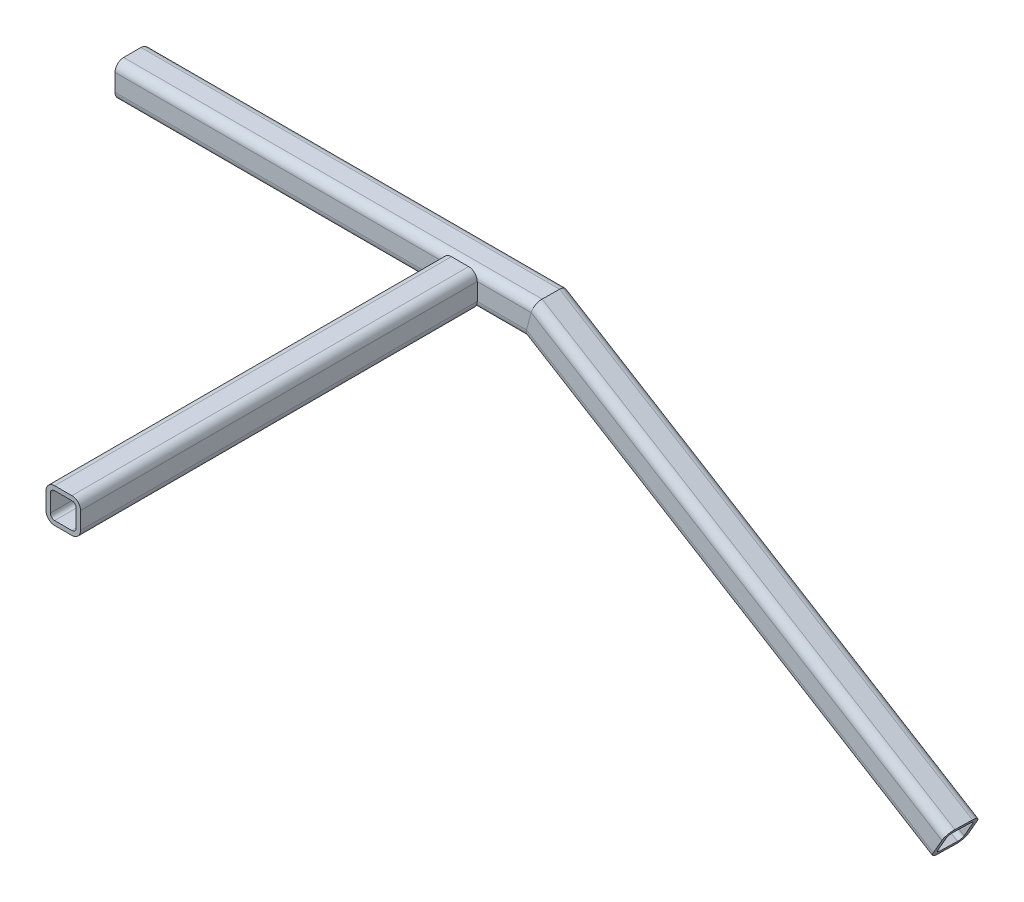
ISO-10303-21;
HEADER;
FILE_DESCRIPTION(('STEP AP214'),'2;1');
FILE_NAME('part.step','',(''),(''),'','','');
FILE_SCHEMA(('AUTOMOTIVE_DESIGN { 1 0 10303 214 1 1 1 1 }'));
ENDSEC;
DATA;
#1=APPLICATION_CONTEXT('core data for automotive mechanical design processes');
#2=APPLICATION_PROTOCOL_DEFINITION('international standard','automotive_design',2000,#1);
#3=PRODUCT_CONTEXT('',#1,'mechanical');
#4=PRODUCT('Part','Part','',(#3));
#5=PRODUCT_RELATED_PRODUCT_CATEGORY('part','',(#4));
#6=PRODUCT_DEFINITION_FORMATION('','',#4);
#7=PRODUCT_DEFINITION_CONTEXT('part definition',#1,'design');
#8=PRODUCT_DEFINITION('design','',#6,#7);
#9=PRODUCT_DEFINITION_SHAPE('','',#8);
#10=(LENGTH_UNIT() NAMED_UNIT(*) SI_UNIT(.MILLI.,.METRE.));
#11=(NAMED_UNIT(*) PLANE_ANGLE_UNIT() SI_UNIT($,.RADIAN.));
#12=(NAMED_UNIT(*) SI_UNIT($,.STERADIAN.) SOLID_ANGLE_UNIT());
#13=UNCERTAINTY_MEASURE_WITH_UNIT(LENGTH_MEASURE(1.E-05),#10,'distance_accuracy_value','');
#14=(GEOMETRIC_REPRESENTATION_CONTEXT(3) GLOBAL_UNCERTAINTY_ASSIGNED_CONTEXT((#13)) GLOBAL_UNIT_ASSIGNED_CONTEXT((#10,
#11,#12)) REPRESENTATION_CONTEXT('',''));
#15=CARTESIAN_POINT('',(0.,0.,0.));
#16=DIRECTION('',(0.,0.,1.));
#17=DIRECTION('',(1.,0.,0.));
#18=AXIS2_PLACEMENT_3D('',#15,#16,#17);
#19=CARTESIAN_POINT('',(1232.10881416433,-344.397218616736,1.16279696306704));
#20=DIRECTION('',(-0.866025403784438,0.499623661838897,-0.0193957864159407));
#21=DIRECTION('',(-0.499717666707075,-0.866188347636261,0.));
#22=AXIS2_PLACEMENT_3D('',#19,#20,#21);
#23=CYLINDRICAL_SURFACE('',#22,12.7);
#24=CARTESIAN_POINT('',(613.132399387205,12.7000000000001,-12.7));
#25=DIRECTION('',(-0.965925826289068,0.258624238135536,-0.0100399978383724));
#26=DIRECTION('',(0.258819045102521,0.96519879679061,-0.0374697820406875));
#27=AXIS2_PLACEMENT_3D('',#24,#25,#26);
#28=ELLIPSE('',#27,13.1480074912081,12.7);
#29=CARTESIAN_POINT('',(616.532792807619,25.4,-12.7));
#30=VERTEX_POINT('',#29);
#31=CARTESIAN_POINT('',(613.264405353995,12.6999999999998,-25.4));
#32=VERTEX_POINT('',#31);
#33=EDGE_CURVE('E235',#30,#32,#28,.T.);
#34=ORIENTED_EDGE('',*,*,#33,.F.);
#35=DIRECTION('',(-0.866025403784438,0.499623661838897,-0.0193957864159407));
#36=VECTOR('',#35,1.);
#37=CARTESIAN_POINT('',(1238.45403466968,-333.396135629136,1.22875026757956));
#38=LINE('',#37,#36);
#39=CARTESIAN_POINT('',(1238.45403466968,-333.396135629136,1.22875026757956));
#40=VERTEX_POINT('',#39);
#41=EDGE_CURVE('E291',#40,#30,#38,.T.);
#42=ORIENTED_EDGE('',*,*,#41,.F.);
#43=CARTESIAN_POINT('',(1232.10881416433,-344.397218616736,1.16279696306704));
#44=DIRECTION('',(0.866025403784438,-0.499623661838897,0.0193957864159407));
#45=DIRECTION('',(0.0193957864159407,-0.005193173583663,-0.999798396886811));
#46=AXIS2_PLACEMENT_3D('',#43,#44,#45);
#47=CIRCLE('',#46,12.7);
#48=CARTESIAN_POINT('',(1232.35514065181,-344.463171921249,-11.5346426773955));
#49=VERTEX_POINT('',#48);
#50=EDGE_CURVE('E320',#49,#40,#47,.T.);
#51=ORIENTED_EDGE('',*,*,#50,.F.);
#52=DIRECTION('',(-0.866025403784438,0.499623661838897,-0.0193957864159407));
#53=VECTOR('',#52,1.);
#54=CARTESIAN_POINT('',(1232.35514065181,-344.463171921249,-11.5346426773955));
#55=LINE('',#54,#53);
#56=EDGE_CURVE('E296',#49,#32,#55,.T.);
#57=ORIENTED_EDGE('',*,*,#56,.T.);
#58=EDGE_LOOP('',(#34,#42,#51,#57));
#59=FACE_BOUND('',#58,.T.);
#60=ADVANCED_FACE('F81',(#59),#23,.T.);
#61=CARTESIAN_POINT('',(1238.45403466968,-333.396135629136,1.22875026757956));
#62=DIRECTION('',(-0.499623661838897,-0.866227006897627,-0.00519317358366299));
#63=DIRECTION('',(0.866238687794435,-0.499630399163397,0.));
#64=AXIS2_PLACEMENT_3D('',#61,#62,#63);
#65=PLANE('',#64);
#66=DIRECTION('',(0.010393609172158,0.,-0.999945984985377));
#67=VECTOR('',#66,1.);
#68=CARTESIAN_POINT('',(616.455214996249,25.4,-5.23641158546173));
#69=LINE('',#68,#67);
#70=CARTESIAN_POINT('',(616.268780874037,25.4,12.7));
#71=VERTEX_POINT('',#70);
#72=EDGE_CURVE('E240',#71,#30,#69,.T.);
#73=ORIENTED_EDGE('',*,*,#72,.F.);
#74=DIRECTION('',(-0.866025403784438,0.499623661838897,-0.0193957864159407));
#75=VECTOR('',#74,1.);
#76=CARTESIAN_POINT('',(1237.96138169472,-333.264229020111,26.6236295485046));
#77=LINE('',#76,#75);
#78=CARTESIAN_POINT('',(1237.96138169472,-333.264229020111,26.6236295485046));
#79=VERTEX_POINT('',#78);
#80=EDGE_CURVE('E295',#79,#71,#77,.T.);
#81=ORIENTED_EDGE('',*,*,#80,.F.);
#82=DIRECTION('',(-0.0193957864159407,0.005193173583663,0.999798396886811));
#83=VECTOR('',#82,1.);
#84=CARTESIAN_POINT('',(1238.45403466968,-333.396135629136,1.22875026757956));
#85=LINE('',#84,#83);
#86=EDGE_CURVE('E365',#40,#79,#85,.T.);
#87=ORIENTED_EDGE('',*,*,#86,.F.);
#88=ORIENTED_EDGE('',*,*,#41,.T.);
#89=EDGE_LOOP('',(#73,#81,#87,#88));
#90=FACE_BOUND('',#89,.T.);
#91=ADVANCED_FACE('F395',(#90),#65,.F.);
#92=CARTESIAN_POINT('',(1231.61616118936,-344.265312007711,26.557676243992));
#93=DIRECTION('',(-0.866025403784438,0.499623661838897,-0.0193957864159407));
#94=DIRECTION('',(-0.499717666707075,-0.866188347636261,0.));
#95=AXIS2_PLACEMENT_3D('',#92,#93,#94);
#96=CYLINDRICAL_SURFACE('',#95,12.7);
#97=CARTESIAN_POINT('',(612.868387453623,12.6999999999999,12.7));
#98=DIRECTION('',(-0.965925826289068,0.258624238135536,-0.0100399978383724));
#99=DIRECTION('',(0.258819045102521,0.96519879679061,-0.0374697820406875));
#100=AXIS2_PLACEMENT_3D('',#97,#98,#99);
#101=ELLIPSE('',#100,13.1480074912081,12.7);
#102=CARTESIAN_POINT('',(612.736381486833,12.6999999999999,25.4));
#103=VERTEX_POINT('',#102);
#104=EDGE_CURVE('E13',#103,#71,#101,.T.);
#105=ORIENTED_EDGE('',*,*,#104,.F.);
#106=DIRECTION('',(-0.866025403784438,0.499623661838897,-0.0193957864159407));
#107=VECTOR('',#106,1.);
#108=CARTESIAN_POINT('',(1231.36983470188,-344.199358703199,39.2551158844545));
#109=LINE('',#108,#107);
#110=CARTESIAN_POINT('',(1231.36983470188,-344.199358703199,39.2551158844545));
#111=VERTEX_POINT('',#110);
#112=EDGE_CURVE('E300',#111,#103,#109,.T.);
#113=ORIENTED_EDGE('',*,*,#112,.F.);
#114=CARTESIAN_POINT('',(1231.61616118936,-344.265312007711,26.557676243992));
#115=DIRECTION('',(0.866025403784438,-0.499623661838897,0.0193957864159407));
#116=DIRECTION('',(0.0193957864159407,-0.005193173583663,-0.999798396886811));
#117=AXIS2_PLACEMENT_3D('',#114,#115,#116);
#118=CIRCLE('',#117,12.7);
#119=EDGE_CURVE('E367',#79,#111,#118,.T.);
#120=ORIENTED_EDGE('',*,*,#119,.F.);
#121=ORIENTED_EDGE('',*,*,#80,.T.);
#122=EDGE_LOOP('',(#105,#113,#120,#121));
#123=FACE_BOUND('',#122,.T.);
#124=ADVANCED_FACE('F400',(#123),#96,.T.);
#125=CARTESIAN_POINT('',(1218.67939369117,-366.201524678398,39.1232092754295));
#126=DIRECTION('',(0.0193957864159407,-0.00519317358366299,-0.999798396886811));
#127=DIRECTION('',(-0.999811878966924,0.,-0.0193960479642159));
#128=AXIS2_PLACEMENT_3D('',#125,#126,#127);
#129=PLANE('',#128);
#130=DIRECTION('',(0.258637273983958,0.965974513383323,0.));
#131=VECTOR('',#130,1.);
#132=CARTESIAN_POINT('',(558.606246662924,-189.46858088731,25.4));
#133=LINE('',#132,#131);
#134=CARTESIAN_POINT('',(605.935594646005,-12.6999999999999,25.4));
#135=VERTEX_POINT('',#134);
#136=EDGE_CURVE('E92',#135,#103,#133,.T.);
#137=ORIENTED_EDGE('',*,*,#136,.F.);
#138=DIRECTION('',(-0.866025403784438,0.499623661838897,-0.0193957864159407));
#139=VECTOR('',#138,1.);
#140=CARTESIAN_POINT('',(1218.67939369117,-366.201524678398,39.1232092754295));
#141=LINE('',#140,#139);
#142=CARTESIAN_POINT('',(1218.67939369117,-366.201524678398,39.1232092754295));
#143=VERTEX_POINT('',#142);
#144=EDGE_CURVE('E304',#143,#135,#141,.T.);
#145=ORIENTED_EDGE('',*,*,#144,.F.);
#146=DIRECTION('',(-0.499623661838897,-0.866227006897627,-0.005193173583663));
#147=VECTOR('',#146,1.);
#148=CARTESIAN_POINT('',(1218.67939369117,-366.201524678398,39.1232092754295));
#149=LINE('',#148,#147);
#150=EDGE_CURVE('E370',#111,#143,#149,.T.);
#151=ORIENTED_EDGE('',*,*,#150,.F.);
#152=ORIENTED_EDGE('',*,*,#112,.T.);
#153=EDGE_LOOP('',(#137,#145,#151,#152));
#154=FACE_BOUND('',#153,.T.);
#155=ADVANCED_FACE('F404',(#154),#129,.F.);
#156=CARTESIAN_POINT('',(1218.92572017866,-366.267477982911,26.425769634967));
#157=DIRECTION('',(-0.866025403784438,0.499623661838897,-0.0193957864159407));
#158=DIRECTION('',(-0.499717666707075,-0.866188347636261,0.));
#159=AXIS2_PLACEMENT_3D('',#156,#157,#158);
#160=CYLINDRICAL_SURFACE('',#159,12.7);
#161=CARTESIAN_POINT('',(606.067600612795,-12.7,12.7));
#162=DIRECTION('',(-0.965925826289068,0.258624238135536,-0.0100399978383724));
#163=DIRECTION('',(0.258819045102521,0.96519879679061,-0.0374697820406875));
#164=AXIS2_PLACEMENT_3D('',#161,#162,#163);
#165=ELLIPSE('',#164,13.1480074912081,12.7);
#166=CARTESIAN_POINT('',(602.667207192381,-25.3999999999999,12.7));
#167=VERTEX_POINT('',#166);
#168=EDGE_CURVE('E248',#167,#135,#165,.T.);
#169=ORIENTED_EDGE('',*,*,#168,.F.);
#170=DIRECTION('',(-0.866025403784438,0.499623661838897,-0.0193957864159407));
#171=VECTOR('',#170,1.);
#172=CARTESIAN_POINT('',(1212.5804996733,-377.268560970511,26.3598163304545));
#173=LINE('',#172,#171);
#174=CARTESIAN_POINT('',(1212.5804996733,-377.268560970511,26.3598163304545));
#175=VERTEX_POINT('',#174);
#176=EDGE_CURVE('E308',#175,#167,#173,.T.);
#177=ORIENTED_EDGE('',*,*,#176,.F.);
#178=CARTESIAN_POINT('',(1218.92572017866,-366.267477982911,26.425769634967));
#179=DIRECTION('',(0.866025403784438,-0.499623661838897,0.0193957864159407));
#180=DIRECTION('',(0.0193957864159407,-0.005193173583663,-0.999798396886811));
#181=AXIS2_PLACEMENT_3D('',#178,#179,#180);
#182=CIRCLE('',#181,12.7);
#183=EDGE_CURVE('E373',#143,#175,#182,.T.);
#184=ORIENTED_EDGE('',*,*,#183,.F.);
#185=ORIENTED_EDGE('',*,*,#144,.T.);
#186=EDGE_LOOP('',(#169,#177,#184,#185));
#187=FACE_BOUND('',#186,.T.);
#188=ADVANCED_FACE('F411',(#187),#160,.T.);
#189=CARTESIAN_POINT('',(1212.5804996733,-377.268560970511,26.3598163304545));
#190=DIRECTION('',(0.499623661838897,0.866227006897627,0.00519317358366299));
#191=DIRECTION('',(-0.866238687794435,0.499630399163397,0.));
#192=AXIS2_PLACEMENT_3D('',#189,#190,#191);
#193=PLANE('',#192);
#194=DIRECTION('',(-0.010393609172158,0.,0.999945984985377));
#195=VECTOR('',#194,1.);
#196=CARTESIAN_POINT('',(602.591127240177,-25.3999999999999,20.019482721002));
#197=LINE('',#196,#195);
#198=CARTESIAN_POINT('',(602.931219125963,-25.4,-12.7));
#199=VERTEX_POINT('',#198);
#200=EDGE_CURVE('E252',#199,#167,#197,.T.);
#201=ORIENTED_EDGE('',*,*,#200,.F.);
#202=DIRECTION('',(-0.866025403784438,0.499623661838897,-0.0193957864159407));
#203=VECTOR('',#202,1.);
#204=CARTESIAN_POINT('',(1213.07315264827,-377.400467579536,0.964937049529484));
#205=LINE('',#204,#203);
#206=CARTESIAN_POINT('',(1213.07315264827,-377.400467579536,0.964937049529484));
#207=VERTEX_POINT('',#206);
#208=EDGE_CURVE('E312',#207,#199,#205,.T.);
#209=ORIENTED_EDGE('',*,*,#208,.F.);
#210=DIRECTION('',(0.0193957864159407,-0.005193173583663,-0.999798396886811));
#211=VECTOR('',#210,1.);
#212=CARTESIAN_POINT('',(1212.5804996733,-377.268560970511,26.3598163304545));
#213=LINE('',#212,#211);
#214=EDGE_CURVE('E376',#175,#207,#213,.T.);
#215=ORIENTED_EDGE('',*,*,#214,.F.);
#216=ORIENTED_EDGE('',*,*,#176,.T.);
#217=EDGE_LOOP('',(#201,#209,#215,#216));
#218=FACE_BOUND('',#217,.T.);
#219=ADVANCED_FACE('F413',(#218),#193,.F.);
#220=CARTESIAN_POINT('',(1219.41837315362,-366.399384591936,1.030890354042));
#221=DIRECTION('',(-0.866025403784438,0.499623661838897,-0.0193957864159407));
#222=DIRECTION('',(-0.499717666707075,-0.866188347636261,0.));
#223=AXIS2_PLACEMENT_3D('',#220,#221,#222);
#224=CYLINDRICAL_SURFACE('',#223,12.7);
#225=CARTESIAN_POINT('',(606.331612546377,-12.6999999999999,-12.7));
#226=DIRECTION('',(-0.965925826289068,0.258624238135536,-0.0100399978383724));
#227=DIRECTION('',(0.258819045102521,0.96519879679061,-0.0374697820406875));
#228=AXIS2_PLACEMENT_3D('',#225,#226,#227);
#229=ELLIPSE('',#228,13.1480074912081,12.7);
#230=CARTESIAN_POINT('',(606.463618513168,-12.7000000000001,-25.4));
#231=VERTEX_POINT('',#230);
#232=EDGE_CURVE('E256',#231,#199,#229,.T.);
#233=ORIENTED_EDGE('',*,*,#232,.F.);
#234=DIRECTION('',(-0.866025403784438,0.499623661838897,-0.0193957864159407));
#235=VECTOR('',#234,1.);
#236=CARTESIAN_POINT('',(1219.6646996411,-366.465337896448,-11.6665492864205));
#237=LINE('',#236,#235);
#238=CARTESIAN_POINT('',(1219.6646996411,-366.465337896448,-11.6665492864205));
#239=VERTEX_POINT('',#238);
#240=EDGE_CURVE('E316',#239,#231,#237,.T.);
#241=ORIENTED_EDGE('',*,*,#240,.F.);
#242=CARTESIAN_POINT('',(1219.41837315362,-366.399384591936,1.030890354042));
#243=DIRECTION('',(0.866025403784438,-0.499623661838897,0.0193957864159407));
#244=DIRECTION('',(0.0193957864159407,-0.005193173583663,-0.999798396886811));
#245=AXIS2_PLACEMENT_3D('',#242,#243,#244);
#246=CIRCLE('',#245,12.7);
#247=EDGE_CURVE('E379',#207,#239,#246,.T.);
#248=ORIENTED_EDGE('',*,*,#247,.F.);
#249=ORIENTED_EDGE('',*,*,#208,.T.);
#250=EDGE_LOOP('',(#233,#241,#248,#249));
#251=FACE_BOUND('',#250,.T.);
#252=ADVANCED_FACE('F416',(#251),#224,.T.);
#253=CARTESIAN_POINT('',(1231.61616118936,-344.265312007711,26.557676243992));
#254=DIRECTION('',(-0.866025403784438,0.499623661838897,-0.0193957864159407));
#255=DIRECTION('',(-0.499717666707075,-0.866188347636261,0.));
#256=AXIS2_PLACEMENT_3D('',#253,#254,#255);
#257=CYLINDRICAL_SURFACE('',#256,6.35);
#258=DIRECTION('',(-0.866025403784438,0.499623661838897,-0.0193957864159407));
#259=VECTOR('',#258,1.);
#260=CARTESIAN_POINT('',(1231.49299794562,-344.232335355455,32.9063960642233));
#261=LINE('',#260,#259);
#262=CARTESIAN_POINT('',(1231.49299794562,-344.232335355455,32.9063960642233));
#263=VERTEX_POINT('',#262);
#264=CARTESIAN_POINT('',(612.802384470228,12.6999999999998,19.05));
#265=VERTEX_POINT('',#264);
#266=EDGE_CURVE('E85',#263,#265,#261,.T.);
#267=ORIENTED_EDGE('',*,*,#266,.T.);
#268=CARTESIAN_POINT('',(612.868387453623,12.6999999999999,12.7));
#269=DIRECTION('',(-0.965925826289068,0.258624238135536,-0.0100399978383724));
#270=DIRECTION('',(0.258819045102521,0.96519879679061,-0.0374697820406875));
#271=AXIS2_PLACEMENT_3D('',#268,#269,#270);
#272=ELLIPSE('',#271,6.57400374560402,6.35);
#273=CARTESIAN_POINT('',(614.56858416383,19.05,12.7));
#274=VERTEX_POINT('',#273);
#275=EDGE_CURVE('E128',#265,#274,#272,.T.);
#276=ORIENTED_EDGE('',*,*,#275,.T.);
#277=DIRECTION('',(-0.866025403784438,0.499623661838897,-0.0193957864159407));
#278=VECTOR('',#277,1.);
#279=CARTESIAN_POINT('',(1234.78877144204,-338.764770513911,26.5906528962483));
#280=LINE('',#279,#278);
#281=CARTESIAN_POINT('',(1234.78877144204,-338.764770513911,26.5906528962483));
#282=VERTEX_POINT('',#281);
#283=EDGE_CURVE('E202',#282,#274,#280,.T.);
#284=ORIENTED_EDGE('',*,*,#283,.F.);
#285=CARTESIAN_POINT('',(1231.61616118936,-344.265312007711,26.557676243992));
#286=DIRECTION('',(0.866025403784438,-0.499623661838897,0.0193957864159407));
#287=DIRECTION('',(0.0193957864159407,-0.005193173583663,-0.999798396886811));
#288=AXIS2_PLACEMENT_3D('',#285,#286,#287);
#289=CIRCLE('',#288,6.35);
#290=EDGE_CURVE('E205',#282,#263,#289,.T.);
#291=ORIENTED_EDGE('',*,*,#290,.T.);
#292=EDGE_LOOP('',(#267,#276,#284,#291));
#293=FACE_BOUND('',#292,.T.);
#294=ADVANCED_FACE('F204',(#293),#257,.F.);
#295=CARTESIAN_POINT('',(1235.28142441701,-338.896677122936,1.1957736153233));
#296=DIRECTION('',(-0.499623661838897,-0.866227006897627,-0.00519317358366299));
#297=DIRECTION('',(0.866238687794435,-0.499630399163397,0.));
#298=AXIS2_PLACEMENT_3D('',#295,#296,#297);
#299=PLANE('',#298);
#300=ORIENTED_EDGE('',*,*,#283,.T.);
#301=DIRECTION('',(0.010393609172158,0.,-0.999945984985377));
#302=VECTOR('',#301,1.);
#303=CARTESIAN_POINT('',(614.755201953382,19.05,-5.25408181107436));
#304=LINE('',#303,#302);
#305=CARTESIAN_POINT('',(614.832596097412,19.05,-12.7));
#306=VERTEX_POINT('',#305);
#307=EDGE_CURVE('E101',#274,#306,#304,.T.);
#308=ORIENTED_EDGE('',*,*,#307,.T.);
#309=DIRECTION('',(-0.866025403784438,0.499623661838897,-0.0193957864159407));
#310=VECTOR('',#309,1.);
#311=CARTESIAN_POINT('',(1235.28142441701,-338.896677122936,1.1957736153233));
#312=LINE('',#311,#310);
#313=CARTESIAN_POINT('',(1235.28142441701,-338.896677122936,1.1957736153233));
#314=VERTEX_POINT('',#313);
#315=EDGE_CURVE('E197',#314,#306,#312,.T.);
#316=ORIENTED_EDGE('',*,*,#315,.F.);
#317=DIRECTION('',(-0.0193957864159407,0.005193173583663,0.999798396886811));
#318=VECTOR('',#317,1.);
#319=CARTESIAN_POINT('',(1235.28142441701,-338.896677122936,1.1957736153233));
#320=LINE('',#319,#318);
#321=EDGE_CURVE('E213',#314,#282,#320,.T.);
#322=ORIENTED_EDGE('',*,*,#321,.T.);
#323=EDGE_LOOP('',(#300,#308,#316,#322));
#324=FACE_BOUND('',#323,.T.);
#325=ADVANCED_FACE('F220',(#324),#299,.T.);
#326=CARTESIAN_POINT('',(1232.10881416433,-344.397218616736,1.16279696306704));
#327=DIRECTION('',(-0.866025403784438,0.499623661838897,-0.0193957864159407));
#328=DIRECTION('',(-0.499717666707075,-0.866188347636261,0.));
#329=AXIS2_PLACEMENT_3D('',#326,#327,#328);
#330=CYLINDRICAL_SURFACE('',#329,6.35);
#331=ORIENTED_EDGE('',*,*,#315,.T.);
#332=CARTESIAN_POINT('',(613.132399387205,12.7000000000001,-12.7));
#333=DIRECTION('',(-0.965925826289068,0.258624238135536,-0.0100399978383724));
#334=DIRECTION('',(0.258819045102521,0.96519879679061,-0.0374697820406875));
#335=AXIS2_PLACEMENT_3D('',#332,#333,#334);
#336=ELLIPSE('',#335,6.57400374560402,6.35);
#337=CARTESIAN_POINT('',(613.1984023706,12.7,-19.05));
#338=VERTEX_POINT('',#337);
#339=EDGE_CURVE('E225',#306,#338,#336,.T.);
#340=ORIENTED_EDGE('',*,*,#339,.T.);
#341=DIRECTION('',(-0.866025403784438,0.499623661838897,-0.0193957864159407));
#342=VECTOR('',#341,1.);
#343=CARTESIAN_POINT('',(1232.23197740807,-344.430195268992,-5.18592285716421));
#344=LINE('',#343,#342);
#345=CARTESIAN_POINT('',(1232.23197740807,-344.430195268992,-5.18592285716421));
#346=VERTEX_POINT('',#345);
#347=EDGE_CURVE('E270',#346,#338,#344,.T.);
#348=ORIENTED_EDGE('',*,*,#347,.F.);
#349=CARTESIAN_POINT('',(1232.10881416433,-344.397218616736,1.16279696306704));
#350=DIRECTION('',(0.866025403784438,-0.499623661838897,0.0193957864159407));
#351=DIRECTION('',(0.0193957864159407,-0.005193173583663,-0.999798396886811));
#352=AXIS2_PLACEMENT_3D('',#349,#350,#351);
#353=CIRCLE('',#352,6.35);
#354=EDGE_CURVE('E229',#346,#314,#353,.T.);
#355=ORIENTED_EDGE('',*,*,#354,.T.);
#356=EDGE_LOOP('',(#331,#340,#348,#355));
#357=FACE_BOUND('',#356,.T.);
#358=ADVANCED_FACE('F467',(#357),#330,.F.);
#359=CARTESIAN_POINT('',(1232.23197740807,-344.430195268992,-5.18592285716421));
#360=DIRECTION('',(-0.0193957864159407,0.00519317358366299,0.999798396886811));
#361=DIRECTION('',(0.999811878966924,0.,0.0193960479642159));
#362=AXIS2_PLACEMENT_3D('',#359,#360,#361);
#363=PLANE('',#362);
#364=ORIENTED_EDGE('',*,*,#347,.T.);
#365=DIRECTION('',(-0.258637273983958,-0.965974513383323,0.));
#366=VECTOR('',#365,1.);
#367=CARTESIAN_POINT('',(565.383221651,-165.883099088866,-19.05));
#368=LINE('',#367,#366);
#369=CARTESIAN_POINT('',(606.397615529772,-12.7,-19.05));
#370=VERTEX_POINT('',#369);
#371=EDGE_CURVE('E265',#338,#370,#368,.T.);
#372=ORIENTED_EDGE('',*,*,#371,.T.);
#373=DIRECTION('',(-0.866025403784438,0.499623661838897,-0.0193957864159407));
#374=VECTOR('',#373,1.);
#375=CARTESIAN_POINT('',(1219.54153639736,-366.432361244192,-5.31782946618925));
#376=LINE('',#375,#374);
#377=CARTESIAN_POINT('',(1219.54153639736,-366.432361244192,-5.31782946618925));
#378=VERTEX_POINT('',#377);
#379=EDGE_CURVE('E276',#378,#370,#376,.T.);
#380=ORIENTED_EDGE('',*,*,#379,.F.);
#381=DIRECTION('',(0.499623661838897,0.866227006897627,0.005193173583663));
#382=VECTOR('',#381,1.);
#383=CARTESIAN_POINT('',(1232.23197740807,-344.430195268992,-5.18592285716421));
#384=LINE('',#383,#382);
#385=EDGE_CURVE('E269',#378,#346,#384,.T.);
#386=ORIENTED_EDGE('',*,*,#385,.T.);
#387=EDGE_LOOP('',(#364,#372,#380,#386));
#388=FACE_BOUND('',#387,.T.);
#389=ADVANCED_FACE('F353',(#388),#363,.T.);
#390=CARTESIAN_POINT('',(1219.41837315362,-366.399384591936,1.030890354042));
#391=DIRECTION('',(-0.866025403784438,0.499623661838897,-0.0193957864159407));
#392=DIRECTION('',(-0.499717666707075,-0.866188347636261,0.));
#393=AXIS2_PLACEMENT_3D('',#390,#391,#392);
#394=CYLINDRICAL_SURFACE('',#393,6.35);
#395=ORIENTED_EDGE('',*,*,#379,.T.);
#396=CARTESIAN_POINT('',(606.331612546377,-12.6999999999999,-12.7));
#397=DIRECTION('',(-0.965925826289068,0.258624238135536,-0.0100399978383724));
#398=DIRECTION('',(0.258819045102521,0.96519879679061,-0.0374697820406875));
#399=AXIS2_PLACEMENT_3D('',#396,#397,#398);
#400=ELLIPSE('',#399,6.57400374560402,6.35);
#401=CARTESIAN_POINT('',(604.631415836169,-19.0499999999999,-12.7));
#402=VERTEX_POINT('',#401);
#403=EDGE_CURVE('E271',#370,#402,#400,.T.);
#404=ORIENTED_EDGE('',*,*,#403,.T.);
#405=DIRECTION('',(-0.866025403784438,0.499623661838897,-0.0193957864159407));
#406=VECTOR('',#405,1.);
#407=CARTESIAN_POINT('',(1216.24576290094,-371.899926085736,0.997913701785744));
#408=LINE('',#407,#406);
#409=CARTESIAN_POINT('',(1216.24576290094,-371.899926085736,0.997913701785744));
#410=VERTEX_POINT('',#409);
#411=EDGE_CURVE('E282',#410,#402,#408,.T.);
#412=ORIENTED_EDGE('',*,*,#411,.F.);
#413=CARTESIAN_POINT('',(1219.41837315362,-366.399384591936,1.030890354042));
#414=DIRECTION('',(0.866025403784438,-0.499623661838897,0.0193957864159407));
#415=DIRECTION('',(0.0193957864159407,-0.005193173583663,-0.999798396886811));
#416=AXIS2_PLACEMENT_3D('',#413,#414,#415);
#417=CIRCLE('',#416,6.35);
#418=EDGE_CURVE('E275',#410,#378,#417,.T.);
#419=ORIENTED_EDGE('',*,*,#418,.T.);
#420=EDGE_LOOP('',(#395,#404,#412,#419));
#421=FACE_BOUND('',#420,.T.);
#422=ADVANCED_FACE('F357',(#421),#394,.F.);
#423=CARTESIAN_POINT('',(1215.75310992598,-371.768019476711,26.3927929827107));
#424=DIRECTION('',(0.499623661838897,0.866227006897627,0.00519317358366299));
#425=DIRECTION('',(-0.866238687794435,0.499630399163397,0.));
#426=AXIS2_PLACEMENT_3D('',#423,#424,#425);
#427=PLANE('',#426);
#428=ORIENTED_EDGE('',*,*,#411,.T.);
#429=DIRECTION('',(-0.010393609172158,0.,0.999945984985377));
#430=VECTOR('',#429,1.);
#431=CARTESIAN_POINT('',(604.291140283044,-19.0499999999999,20.0371529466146));
#432=LINE('',#431,#430);
#433=CARTESIAN_POINT('',(604.367403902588,-19.0499999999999,12.7));
#434=VERTEX_POINT('',#433);
#435=EDGE_CURVE('E277',#402,#434,#432,.T.);
#436=ORIENTED_EDGE('',*,*,#435,.T.);
#437=DIRECTION('',(-0.866025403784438,0.499623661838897,-0.0193957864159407));
#438=VECTOR('',#437,1.);
#439=CARTESIAN_POINT('',(1215.75310992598,-371.768019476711,26.3927929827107));
#440=LINE('',#439,#438);
#441=CARTESIAN_POINT('',(1215.75310992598,-371.768019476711,26.3927929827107));
#442=VERTEX_POINT('',#441);
#443=EDGE_CURVE('E287',#442,#434,#440,.T.);
#444=ORIENTED_EDGE('',*,*,#443,.F.);
#445=DIRECTION('',(0.0193957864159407,-0.005193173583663,-0.999798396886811));
#446=VECTOR('',#445,1.);
#447=CARTESIAN_POINT('',(1215.75310992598,-371.768019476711,26.3927929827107));
#448=LINE('',#447,#446);
#449=EDGE_CURVE('E281',#442,#410,#448,.T.);
#450=ORIENTED_EDGE('',*,*,#449,.T.);
#451=EDGE_LOOP('',(#428,#436,#444,#450));
#452=FACE_BOUND('',#451,.T.);
#453=ADVANCED_FACE('F359',(#452),#427,.T.);
#454=CARTESIAN_POINT('',(1218.92572017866,-366.267477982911,26.425769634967));
#455=DIRECTION('',(-0.866025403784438,0.499623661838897,-0.0193957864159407));
#456=DIRECTION('',(-0.499717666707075,-0.866188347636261,0.));
#457=AXIS2_PLACEMENT_3D('',#454,#455,#456);
#458=CYLINDRICAL_SURFACE('',#457,6.35);
#459=ORIENTED_EDGE('',*,*,#443,.T.);
#460=CARTESIAN_POINT('',(606.067600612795,-12.7,12.7));
#461=DIRECTION('',(-0.965925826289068,0.258624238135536,-0.0100399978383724));
#462=DIRECTION('',(0.258819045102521,0.96519879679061,-0.0374697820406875));
#463=AXIS2_PLACEMENT_3D('',#460,#461,#462);
#464=ELLIPSE('',#463,6.57400374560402,6.35);
#465=CARTESIAN_POINT('',(606.0015976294,-12.7000000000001,19.05));
#466=VERTEX_POINT('',#465);
#467=EDGE_CURVE('E283',#434,#466,#464,.T.);
#468=ORIENTED_EDGE('',*,*,#467,.T.);
#469=DIRECTION('',(-0.866025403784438,0.499623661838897,-0.0193957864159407));
#470=VECTOR('',#469,1.);
#471=CARTESIAN_POINT('',(1218.80255693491,-366.234501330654,32.7744894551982));
#472=LINE('',#471,#470);
#473=CARTESIAN_POINT('',(1218.80255693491,-366.234501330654,32.7744894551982));
#474=VERTEX_POINT('',#473);
#475=EDGE_CURVE('E234',#474,#466,#472,.T.);
#476=ORIENTED_EDGE('',*,*,#475,.F.);
#477=CARTESIAN_POINT('',(1218.92572017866,-366.267477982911,26.425769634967));
#478=DIRECTION('',(0.866025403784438,-0.499623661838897,0.0193957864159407));
#479=DIRECTION('',(0.0193957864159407,-0.005193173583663,-0.999798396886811));
#480=AXIS2_PLACEMENT_3D('',#477,#478,#479);
#481=CIRCLE('',#480,6.35);
#482=EDGE_CURVE('E286',#474,#442,#481,.T.);
#483=ORIENTED_EDGE('',*,*,#482,.T.);
#484=EDGE_LOOP('',(#459,#468,#476,#483));
#485=FACE_BOUND('',#484,.T.);
#486=ADVANCED_FACE('F505',(#485),#458,.F.);
#487=CARTESIAN_POINT('',(1218.80255693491,-366.234501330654,32.7744894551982));
#488=DIRECTION('',(0.0193957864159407,-0.00519317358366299,-0.999798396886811));
#489=DIRECTION('',(-0.999811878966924,0.,-0.0193960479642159));
#490=AXIS2_PLACEMENT_3D('',#487,#488,#489);
#491=PLANE('',#490);
#492=ORIENTED_EDGE('',*,*,#475,.T.);
#493=DIRECTION('',(0.258637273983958,0.965974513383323,0.));
#494=VECTOR('',#493,1.);
#495=CARTESIAN_POINT('',(558.667834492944,-189.485070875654,19.05));
#496=LINE('',#495,#494);
#497=EDGE_CURVE('E123',#466,#265,#496,.T.);
#498=ORIENTED_EDGE('',*,*,#497,.T.);
#499=ORIENTED_EDGE('',*,*,#266,.F.);
#500=DIRECTION('',(-0.499623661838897,-0.866227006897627,-0.005193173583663));
#501=VECTOR('',#500,1.);
#502=CARTESIAN_POINT('',(1218.80255693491,-366.234501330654,32.7744894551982));
#503=LINE('',#502,#501);
#504=EDGE_CURVE('E217',#263,#474,#503,.T.);
#505=ORIENTED_EDGE('',*,*,#504,.T.);
#506=EDGE_LOOP('',(#492,#498,#499,#505));
#507=FACE_BOUND('',#506,.T.);
#508=ADVANCED_FACE('F360',(#507),#491,.T.);
#509=CARTESIAN_POINT('',(1232.35514065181,-344.463171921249,-11.5346426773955));
#510=DIRECTION('',(-0.0193957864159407,0.00519317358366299,0.999798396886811));
#511=DIRECTION('',(0.999811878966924,0.,0.0193960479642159));
#512=AXIS2_PLACEMENT_3D('',#509,#510,#511);
#513=PLANE('',#512);
#514=DIRECTION('',(-0.258637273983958,-0.965974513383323,0.));
#515=VECTOR('',#514,1.);
#516=CARTESIAN_POINT('',(565.44480948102,-165.899589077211,-25.4));
#517=LINE('',#516,#515);
#518=EDGE_CURVE('E239',#32,#231,#517,.T.);
#519=ORIENTED_EDGE('',*,*,#518,.F.);
#520=ORIENTED_EDGE('',*,*,#56,.F.);
#521=DIRECTION('',(0.499623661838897,0.866227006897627,0.005193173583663));
#522=VECTOR('',#521,1.);
#523=CARTESIAN_POINT('',(1232.35514065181,-344.463171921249,-11.5346426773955));
#524=LINE('',#523,#522);
#525=EDGE_CURVE('E243',#239,#49,#524,.T.);
#526=ORIENTED_EDGE('',*,*,#525,.F.);
#527=ORIENTED_EDGE('',*,*,#240,.T.);
#528=EDGE_LOOP('',(#519,#520,#526,#527));
#529=FACE_BOUND('',#528,.T.);
#530=ADVANCED_FACE('F392',(#529),#513,.F.);
#531=CARTESIAN_POINT('',(1232.10881416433,-344.397218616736,1.16279696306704));
#532=DIRECTION('',(0.866025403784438,-0.499623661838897,0.0193957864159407));
#533=DIRECTION('',(0.0193957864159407,-0.005193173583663,-0.999798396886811));
#534=AXIS2_PLACEMENT_3D('',#531,#532,#533);
#535=PLANE('',#534);
#536=ORIENTED_EDGE('',*,*,#290,.F.);
#537=ORIENTED_EDGE('',*,*,#321,.F.);
#538=ORIENTED_EDGE('',*,*,#354,.F.);
#539=ORIENTED_EDGE('',*,*,#385,.F.);
#540=ORIENTED_EDGE('',*,*,#418,.F.);
#541=ORIENTED_EDGE('',*,*,#449,.F.);
#542=ORIENTED_EDGE('',*,*,#482,.F.);
#543=ORIENTED_EDGE('',*,*,#504,.F.);
#544=EDGE_LOOP('',(#536,#537,#538,#539,#540,#541,#542,#543));
#545=FACE_BOUND('',#544,.T.);
#546=ORIENTED_EDGE('',*,*,#50,.T.);
#547=ORIENTED_EDGE('',*,*,#86,.T.);
#548=ORIENTED_EDGE('',*,*,#119,.T.);
#549=ORIENTED_EDGE('',*,*,#150,.T.);
#550=ORIENTED_EDGE('',*,*,#183,.T.);
#551=ORIENTED_EDGE('',*,*,#214,.T.);
#552=ORIENTED_EDGE('',*,*,#247,.T.);
#553=ORIENTED_EDGE('',*,*,#525,.T.);
#554=EDGE_LOOP('',(#546,#547,#548,#549,#550,#551,#552,#553));
#555=FACE_BOUND('',#554,.T.);
#556=ADVANCED_FACE('F210',(#545,#555),#535,.T.);
#557=CARTESIAN_POINT('',(609.6,0.,0.));
#558=DIRECTION('',(-0.965925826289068,0.258624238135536,-0.0100399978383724));
#559=DIRECTION('',(-0.258637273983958,-0.965974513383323,0.));
#560=AXIS2_PLACEMENT_3D('',#557,#558,#559);
#561=PLANE('',#560);
#562=ORIENTED_EDGE('',*,*,#275,.F.);
#563=ORIENTED_EDGE('',*,*,#497,.F.);
#564=ORIENTED_EDGE('',*,*,#467,.F.);
#565=ORIENTED_EDGE('',*,*,#435,.F.);
#566=ORIENTED_EDGE('',*,*,#403,.F.);
#567=ORIENTED_EDGE('',*,*,#371,.F.);
#568=ORIENTED_EDGE('',*,*,#339,.F.);
#569=ORIENTED_EDGE('',*,*,#307,.F.);
#570=EDGE_LOOP('',(#562,#563,#564,#565,#566,#567,#568,#569));
#571=FACE_BOUND('',#570,.T.);
#572=ORIENTED_EDGE('',*,*,#72,.T.);
#573=ORIENTED_EDGE('',*,*,#33,.T.);
#574=ORIENTED_EDGE('',*,*,#518,.T.);
#575=ORIENTED_EDGE('',*,*,#232,.T.);
#576=ORIENTED_EDGE('',*,*,#200,.T.);
#577=ORIENTED_EDGE('',*,*,#168,.T.);
#578=ORIENTED_EDGE('',*,*,#136,.T.);
#579=ORIENTED_EDGE('',*,*,#104,.T.);
#580=EDGE_LOOP('',(#572,#573,#574,#575,#576,#577,#578,#579));
#581=FACE_BOUND('',#580,.T.);
#582=ADVANCED_FACE('F83',(#571,#581),#561,.T.);
#583=CLOSED_SHELL('',(#60,#91,#124,#155,#188,#219,#252,#294,#325,#358,#389,#422,#453,#486,#508,
#530,#556,#582));
#584=MANIFOLD_SOLID_BREP('B2',#583);
#585=CARTESIAN_POINT('',(609.6,12.7,-12.7));
#586=DIRECTION('',(-1.,0.,0.));
#587=DIRECTION('',(0.,0.,1.));
#588=AXIS2_PLACEMENT_3D('',#585,#586,#587);
#589=CYLINDRICAL_SURFACE('',#588,12.7);
#590=CARTESIAN_POINT('',(613.132399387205,12.7,-12.7));
#591=DIRECTION('',(0.965925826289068,-0.258624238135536,0.0100399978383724));
#592=DIRECTION('',(-0.258819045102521,-0.965198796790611,0.0374697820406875));
#593=AXIS2_PLACEMENT_3D('',#590,#591,#592);
#594=ELLIPSE('',#593,13.1480074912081,12.7);
#595=CARTESIAN_POINT('',(613.264405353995,12.7,-25.4));
#596=VERTEX_POINT('',#595);
#597=CARTESIAN_POINT('',(616.532792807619,25.4,-12.7));
#598=VERTEX_POINT('',#597);
#599=EDGE_CURVE('E794',#596,#598,#594,.T.);
#600=ORIENTED_EDGE('',*,*,#599,.F.);
#601=DIRECTION('',(-1.,0.,0.));
#602=VECTOR('',#601,1.);
#603=CARTESIAN_POINT('',(609.6,12.7,-25.4));
#604=LINE('',#603,#602);
#605=CARTESIAN_POINT('',(0.,12.7,-25.4));
#606=VERTEX_POINT('',#605);
#607=EDGE_CURVE('E790',#596,#606,#604,.T.);
#608=ORIENTED_EDGE('',*,*,#607,.T.);
#609=CARTESIAN_POINT('',(0.,12.7,-12.7));
#610=DIRECTION('',(1.,0.,0.));
#611=DIRECTION('',(0.,0.,-1.));
#612=AXIS2_PLACEMENT_3D('',#609,#610,#611);
#613=CIRCLE('',#612,12.7);
#614=CARTESIAN_POINT('',(0.,25.4,-12.7));
#615=VERTEX_POINT('',#614);
#616=EDGE_CURVE('E845',#606,#615,#613,.T.);
#617=ORIENTED_EDGE('',*,*,#616,.T.);
#618=DIRECTION('',(-1.,0.,0.));
#619=VECTOR('',#618,1.);
#620=CARTESIAN_POINT('',(609.6,25.4,-12.7));
#621=LINE('',#620,#619);
#622=EDGE_CURVE('E842',#598,#615,#621,.T.);
#623=ORIENTED_EDGE('',*,*,#622,.F.);
#624=EDGE_LOOP('',(#600,#608,#617,#623));
#625=FACE_BOUND('',#624,.T.);
#626=ADVANCED_FACE('F665',(#625),#589,.T.);
#627=CARTESIAN_POINT('',(609.6,25.4,-12.7));
#628=DIRECTION('',(0.,-1.,0.));
#629=DIRECTION('',(0.,0.,-1.));
#630=AXIS2_PLACEMENT_3D('',#627,#628,#629);
#631=PLANE('',#630);
#632=DIRECTION('',(-0.010393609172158,0.,0.999945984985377));
#633=VECTOR('',#632,1.);
#634=CARTESIAN_POINT('',(616.532043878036,25.4,-12.6279471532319));
#635=LINE('',#634,#633);
#636=CARTESIAN_POINT('',(616.268780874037,25.4,12.7));
#637=VERTEX_POINT('',#636);
#638=EDGE_CURVE('E812',#598,#637,#635,.T.);
#639=ORIENTED_EDGE('',*,*,#638,.F.);
#640=ORIENTED_EDGE('',*,*,#622,.T.);
#641=DIRECTION('',(0.,0.,1.));
#642=VECTOR('',#641,1.);
#643=CARTESIAN_POINT('',(0.,25.4,-12.7));
#644=LINE('',#643,#642);
#645=CARTESIAN_POINT('',(0.,25.4,12.7));
#646=VERTEX_POINT('',#645);
#647=EDGE_CURVE('E844',#615,#646,#644,.T.);
#648=ORIENTED_EDGE('',*,*,#647,.T.);
#649=DIRECTION('',(-1.,0.,0.));
#650=VECTOR('',#649,1.);
#651=CARTESIAN_POINT('',(609.6,25.4,12.7));
#652=LINE('',#651,#650);
#653=EDGE_CURVE('E846',#637,#646,#652,.T.);
#654=ORIENTED_EDGE('',*,*,#653,.F.);
#655=EDGE_LOOP('',(#639,#640,#648,#654));
#656=FACE_BOUND('',#655,.T.);
#657=ADVANCED_FACE('F917',(#656),#631,.F.);
#658=CARTESIAN_POINT('',(609.6,12.7,12.7));
#659=DIRECTION('',(-1.,0.,0.));
#660=DIRECTION('',(0.,0.,1.));
#661=AXIS2_PLACEMENT_3D('',#658,#659,#660);
#662=CYLINDRICAL_SURFACE('',#661,12.7);
#663=CARTESIAN_POINT('',(612.868387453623,12.7,12.7));
#664=DIRECTION('',(0.965925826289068,-0.258624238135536,0.0100399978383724));
#665=DIRECTION('',(-0.258819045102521,-0.965198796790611,0.0374697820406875));
#666=AXIS2_PLACEMENT_3D('',#663,#664,#665);
#667=ELLIPSE('',#666,13.1480074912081,12.7);
#668=CARTESIAN_POINT('',(612.736381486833,12.7,25.4));
#669=VERTEX_POINT('',#668);
#670=EDGE_CURVE('E809',#637,#669,#667,.T.);
#671=ORIENTED_EDGE('',*,*,#670,.F.);
#672=ORIENTED_EDGE('',*,*,#653,.T.);
#673=CARTESIAN_POINT('',(0.,12.7,12.7));
#674=DIRECTION('',(1.,0.,0.));
#675=DIRECTION('',(0.,0.,-1.));
#676=AXIS2_PLACEMENT_3D('',#673,#674,#675);
#677=CIRCLE('',#676,12.7);
#678=CARTESIAN_POINT('',(0.,12.7,25.4));
#679=VERTEX_POINT('',#678);
#680=EDGE_CURVE('E848',#646,#679,#677,.T.);
#681=ORIENTED_EDGE('',*,*,#680,.T.);
#682=DIRECTION('',(-1.,0.,0.));
#683=VECTOR('',#682,1.);
#684=CARTESIAN_POINT('',(609.6,12.7,25.4));
#685=LINE('',#684,#683);
#686=EDGE_CURVE('E849',#669,#679,#685,.T.);
#687=ORIENTED_EDGE('',*,*,#686,.F.);
#688=EDGE_LOOP('',(#671,#672,#681,#687));
#689=FACE_BOUND('',#688,.T.);
#690=ADVANCED_FACE('F919',(#689),#662,.T.);
#691=CARTESIAN_POINT('',(609.6,-12.7,25.4));
#692=DIRECTION('',(0.,0.,-1.));
#693=DIRECTION('',(-1.,0.,0.));
#694=AXIS2_PLACEMENT_3D('',#691,#692,#693);
#695=PLANE('',#694);
#696=DIRECTION('',(-0.258637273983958,-0.965974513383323,0.));
#697=VECTOR('',#696,1.);
#698=CARTESIAN_POINT('',(606.180718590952,-11.7844959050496,25.4));
#699=LINE('',#698,#697);
#700=CARTESIAN_POINT('',(605.935594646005,-12.7,25.4));
#701=VERTEX_POINT('',#700);
#702=EDGE_CURVE('E804',#669,#701,#699,.T.);
#703=ORIENTED_EDGE('',*,*,#702,.F.);
#704=ORIENTED_EDGE('',*,*,#686,.T.);
#705=DIRECTION('',(0.,-1.,0.));
#706=VECTOR('',#705,1.);
#707=CARTESIAN_POINT('',(0.,-12.7,25.4));
#708=LINE('',#707,#706);
#709=CARTESIAN_POINT('',(0.,-12.7,25.4));
#710=VERTEX_POINT('',#709);
#711=EDGE_CURVE('E851',#679,#710,#708,.T.);
#712=ORIENTED_EDGE('',*,*,#711,.T.);
#713=DIRECTION('',(-1.,0.,0.));
#714=VECTOR('',#713,1.);
#715=CARTESIAN_POINT('',(609.6,-12.7,25.4));
#716=LINE('',#715,#714);
#717=EDGE_CURVE('E852',#701,#710,#716,.T.);
#718=ORIENTED_EDGE('',*,*,#717,.F.);
#719=EDGE_LOOP('',(#703,#704,#712,#718));
#720=FACE_BOUND('',#719,.T.);
#721=ADVANCED_FACE('F923',(#720),#695,.F.);
#722=CARTESIAN_POINT('',(609.6,-12.7,12.7));
#723=DIRECTION('',(-1.,0.,0.));
#724=DIRECTION('',(0.,0.,1.));
#725=AXIS2_PLACEMENT_3D('',#722,#723,#724);
#726=CYLINDRICAL_SURFACE('',#725,12.7);
#727=CARTESIAN_POINT('',(606.067600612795,-12.7,12.7));
#728=DIRECTION('',(0.965925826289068,-0.258624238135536,0.0100399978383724));
#729=DIRECTION('',(-0.258819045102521,-0.965198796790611,0.0374697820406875));
#730=AXIS2_PLACEMENT_3D('',#727,#728,#729);
#731=ELLIPSE('',#730,13.1480074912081,12.7);
#732=CARTESIAN_POINT('',(602.667207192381,-25.4,12.7));
#733=VERTEX_POINT('',#732);
#734=EDGE_CURVE('E800',#701,#733,#731,.T.);
#735=ORIENTED_EDGE('',*,*,#734,.F.);
#736=ORIENTED_EDGE('',*,*,#717,.T.);
#737=CARTESIAN_POINT('',(0.,-12.7,12.7));
#738=DIRECTION('',(1.,0.,0.));
#739=DIRECTION('',(0.,0.,-1.));
#740=AXIS2_PLACEMENT_3D('',#737,#738,#739);
#741=CIRCLE('',#740,12.7);
#742=CARTESIAN_POINT('',(0.,-25.4,12.7));
#743=VERTEX_POINT('',#742);
#744=EDGE_CURVE('E854',#710,#743,#741,.T.);
#745=ORIENTED_EDGE('',*,*,#744,.T.);
#746=DIRECTION('',(-1.,0.,0.));
#747=VECTOR('',#746,1.);
#748=CARTESIAN_POINT('',(609.6,-25.4,12.7));
#749=LINE('',#748,#747);
#750=EDGE_CURVE('E855',#733,#743,#749,.T.);
#751=ORIENTED_EDGE('',*,*,#750,.F.);
#752=EDGE_LOOP('',(#735,#736,#745,#751));
#753=FACE_BOUND('',#752,.T.);
#754=ADVANCED_FACE('F927',(#753),#726,.T.);
#755=CARTESIAN_POINT('',(609.6,-25.4,12.7));
#756=DIRECTION('',(0.,1.,0.));
#757=DIRECTION('',(0.,0.,1.));
#758=AXIS2_PLACEMENT_3D('',#755,#756,#757);
#759=PLANE('',#758);
#760=DIRECTION('',(0.010393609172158,0.,-0.999945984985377));
#761=VECTOR('',#760,1.);
#762=CARTESIAN_POINT('',(602.667956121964,-25.4,12.6279471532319));
#763=LINE('',#762,#761);
#764=CARTESIAN_POINT('',(602.931219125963,-25.4,-12.7));
#765=VERTEX_POINT('',#764);
#766=EDGE_CURVE('E675',#733,#765,#763,.T.);
#767=ORIENTED_EDGE('',*,*,#766,.F.);
#768=ORIENTED_EDGE('',*,*,#750,.T.);
#769=DIRECTION('',(0.,0.,-1.));
#770=VECTOR('',#769,1.);
#771=CARTESIAN_POINT('',(0.,-25.4,12.7));
#772=LINE('',#771,#770);
#773=CARTESIAN_POINT('',(0.,-25.4,-12.7));
#774=VERTEX_POINT('',#773);
#775=EDGE_CURVE('E857',#743,#774,#772,.T.);
#776=ORIENTED_EDGE('',*,*,#775,.T.);
#777=DIRECTION('',(-1.,0.,0.));
#778=VECTOR('',#777,1.);
#779=CARTESIAN_POINT('',(609.6,-25.4,-12.7));
#780=LINE('',#779,#778);
#781=EDGE_CURVE('E858',#765,#774,#780,.T.);
#782=ORIENTED_EDGE('',*,*,#781,.F.);
#783=EDGE_LOOP('',(#767,#768,#776,#782));
#784=FACE_BOUND('',#783,.T.);
#785=ADVANCED_FACE('F929',(#784),#759,.F.);
#786=CARTESIAN_POINT('',(609.6,-12.7,-12.7));
#787=DIRECTION('',(-1.,0.,0.));
#788=DIRECTION('',(0.,0.,1.));
#789=AXIS2_PLACEMENT_3D('',#786,#787,#788);
#790=CYLINDRICAL_SURFACE('',#789,12.7);
#791=CARTESIAN_POINT('',(606.331612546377,-12.7,-12.7));
#792=DIRECTION('',(0.965925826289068,-0.258624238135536,0.0100399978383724));
#793=DIRECTION('',(-0.258819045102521,-0.965198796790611,0.0374697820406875));
#794=AXIS2_PLACEMENT_3D('',#791,#792,#793);
#795=ELLIPSE('',#794,13.1480074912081,12.7);
#796=CARTESIAN_POINT('',(606.463618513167,-12.7,-25.4));
#797=VERTEX_POINT('',#796);
#798=EDGE_CURVE('E79',#765,#797,#795,.T.);
#799=ORIENTED_EDGE('',*,*,#798,.F.);
#800=ORIENTED_EDGE('',*,*,#781,.T.);
#801=CARTESIAN_POINT('',(0.,-12.7,-12.7));
#802=DIRECTION('',(1.,0.,0.));
#803=DIRECTION('',(0.,0.,-1.));
#804=AXIS2_PLACEMENT_3D('',#801,#802,#803);
#805=CIRCLE('',#804,12.7);
#806=CARTESIAN_POINT('',(0.,-12.7,-25.4));
#807=VERTEX_POINT('',#806);
#808=EDGE_CURVE('E779',#774,#807,#805,.T.);
#809=ORIENTED_EDGE('',*,*,#808,.T.);
#810=DIRECTION('',(-1.,0.,0.));
#811=VECTOR('',#810,1.);
#812=CARTESIAN_POINT('',(609.6,-12.7,-25.4));
#813=LINE('',#812,#811);
#814=EDGE_CURVE('E774',#797,#807,#813,.T.);
#815=ORIENTED_EDGE('',*,*,#814,.F.);
#816=EDGE_LOOP('',(#799,#800,#809,#815));
#817=FACE_BOUND('',#816,.T.);
#818=ADVANCED_FACE('F776',(#817),#790,.T.);
#819=CARTESIAN_POINT('',(609.6,12.7,12.7));
#820=DIRECTION('',(-1.,0.,0.));
#821=DIRECTION('',(0.,0.,1.));
#822=AXIS2_PLACEMENT_3D('',#819,#820,#821);
#823=CYLINDRICAL_SURFACE('',#822,6.35);
#824=DIRECTION('',(-1.,0.,0.));
#825=VECTOR('',#824,1.);
#826=CARTESIAN_POINT('',(609.6,19.05,12.7));
#827=LINE('',#826,#825);
#828=CARTESIAN_POINT('',(614.56858416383,19.05,12.7));
#829=VERTEX_POINT('',#828);
#830=CARTESIAN_POINT('',(0.,19.05,12.7));
#831=VERTEX_POINT('',#830);
#832=EDGE_CURVE('E821',#829,#831,#827,.T.);
#833=ORIENTED_EDGE('',*,*,#832,.F.);
#834=CARTESIAN_POINT('',(612.868387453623,12.7,12.7));
#835=DIRECTION('',(0.965925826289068,-0.258624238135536,0.0100399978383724));
#836=DIRECTION('',(-0.258819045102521,-0.965198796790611,0.0374697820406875));
#837=AXIS2_PLACEMENT_3D('',#834,#835,#836);
#838=ELLIPSE('',#837,6.57400374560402,6.35);
#839=CARTESIAN_POINT('',(612.802384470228,12.7,19.05));
#840=VERTEX_POINT('',#839);
#841=EDGE_CURVE('E816',#829,#840,#838,.T.);
#842=ORIENTED_EDGE('',*,*,#841,.T.);
#843=DIRECTION('',(-1.,0.,0.));
#844=VECTOR('',#843,1.);
#845=CARTESIAN_POINT('',(609.6,12.7,19.05));
#846=LINE('',#845,#844);
#847=CARTESIAN_POINT('',(0.,12.7,19.05));
#848=VERTEX_POINT('',#847);
#849=EDGE_CURVE('E669',#840,#848,#846,.T.);
#850=ORIENTED_EDGE('',*,*,#849,.T.);
#851=CARTESIAN_POINT('',(0.,12.7,12.7));
#852=DIRECTION('',(1.,0.,0.));
#853=DIRECTION('',(0.,0.,-1.));
#854=AXIS2_PLACEMENT_3D('',#851,#852,#853);
#855=CIRCLE('',#854,6.35);
#856=EDGE_CURVE('E872',#831,#848,#855,.T.);
#857=ORIENTED_EDGE('',*,*,#856,.F.);
#858=EDGE_LOOP('',(#833,#842,#850,#857));
#859=FACE_BOUND('',#858,.T.);
#860=ADVANCED_FACE('F936',(#859),#823,.F.);
#861=CARTESIAN_POINT('',(609.6,19.05,-12.7));
#862=DIRECTION('',(0.,-1.,0.));
#863=DIRECTION('',(0.,0.,-1.));
#864=AXIS2_PLACEMENT_3D('',#861,#862,#863);
#865=PLANE('',#864);
#866=DIRECTION('',(-1.,0.,0.));
#867=VECTOR('',#866,1.);
#868=CARTESIAN_POINT('',(609.6,19.05,-12.7));
#869=LINE('',#868,#867);
#870=CARTESIAN_POINT('',(614.832596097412,19.05,-12.7));
#871=VERTEX_POINT('',#870);
#872=CARTESIAN_POINT('',(0.,19.05,-12.7));
#873=VERTEX_POINT('',#872);
#874=EDGE_CURVE('E825',#871,#873,#869,.T.);
#875=ORIENTED_EDGE('',*,*,#874,.F.);
#876=DIRECTION('',(-0.010393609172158,0.,0.999945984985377));
#877=VECTOR('',#876,1.);
#878=CARTESIAN_POINT('',(614.832030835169,19.05,-12.6456173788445));
#879=LINE('',#878,#877);
#880=EDGE_CURVE('E818',#871,#829,#879,.T.);
#881=ORIENTED_EDGE('',*,*,#880,.T.);
#882=ORIENTED_EDGE('',*,*,#832,.T.);
#883=DIRECTION('',(0.,0.,1.));
#884=VECTOR('',#883,1.);
#885=CARTESIAN_POINT('',(0.,19.05,-12.7));
#886=LINE('',#885,#884);
#887=EDGE_CURVE('E795',#873,#831,#886,.T.);
#888=ORIENTED_EDGE('',*,*,#887,.F.);
#889=EDGE_LOOP('',(#875,#881,#882,#888));
#890=FACE_BOUND('',#889,.T.);
#891=ADVANCED_FACE('F978',(#890),#865,.T.);
#892=CARTESIAN_POINT('',(609.6,12.7,-12.7));
#893=DIRECTION('',(-1.,0.,0.));
#894=DIRECTION('',(0.,0.,1.));
#895=AXIS2_PLACEMENT_3D('',#892,#893,#894);
#896=CYLINDRICAL_SURFACE('',#895,6.35);
#897=DIRECTION('',(-1.,0.,0.));
#898=VECTOR('',#897,1.);
#899=CARTESIAN_POINT('',(609.6,12.7,-19.05));
#900=LINE('',#899,#898);
#901=CARTESIAN_POINT('',(613.1984023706,12.7,-19.05));
#902=VERTEX_POINT('',#901);
#903=CARTESIAN_POINT('',(0.,12.7,-19.05));
#904=VERTEX_POINT('',#903);
#905=EDGE_CURVE('E829',#902,#904,#900,.T.);
#906=ORIENTED_EDGE('',*,*,#905,.F.);
#907=CARTESIAN_POINT('',(613.132399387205,12.7,-12.7));
#908=DIRECTION('',(0.965925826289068,-0.258624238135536,0.0100399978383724));
#909=DIRECTION('',(-0.258819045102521,-0.965198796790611,0.0374697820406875));
#910=AXIS2_PLACEMENT_3D('',#907,#908,#909);
#911=ELLIPSE('',#910,6.57400374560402,6.35);
#912=EDGE_CURVE('E822',#902,#871,#911,.T.);
#913=ORIENTED_EDGE('',*,*,#912,.T.);
#914=ORIENTED_EDGE('',*,*,#874,.T.);
#915=CARTESIAN_POINT('',(0.,12.7,-12.7));
#916=DIRECTION('',(1.,0.,0.));
#917=DIRECTION('',(0.,0.,-1.));
#918=AXIS2_PLACEMENT_3D('',#915,#916,#917);
#919=CIRCLE('',#918,6.35);
#920=EDGE_CURVE('E878',#904,#873,#919,.T.);
#921=ORIENTED_EDGE('',*,*,#920,.F.);
#922=EDGE_LOOP('',(#906,#913,#914,#921));
#923=FACE_BOUND('',#922,.T.);
#924=ADVANCED_FACE('F989',(#923),#896,.F.);
#925=CARTESIAN_POINT('',(609.6,12.7,-19.05));
#926=DIRECTION('',(0.,0.,1.));
#927=DIRECTION('',(1.,0.,0.));
#928=AXIS2_PLACEMENT_3D('',#925,#926,#927);
#929=PLANE('',#928);
#930=DIRECTION('',(-1.,0.,0.));
#931=VECTOR('',#930,1.);
#932=CARTESIAN_POINT('',(609.6,-12.7,-19.05));
#933=LINE('',#932,#931);
#934=CARTESIAN_POINT('',(606.397615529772,-12.7,-19.05));
#935=VERTEX_POINT('',#934);
#936=CARTESIAN_POINT('',(0.,-12.7,-19.05));
#937=VERTEX_POINT('',#936);
#938=EDGE_CURVE('E833',#935,#937,#933,.T.);
#939=ORIENTED_EDGE('',*,*,#938,.F.);
#940=DIRECTION('',(0.258637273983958,0.965974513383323,0.));
#941=VECTOR('',#940,1.);
#942=CARTESIAN_POINT('',(612.957693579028,11.8009858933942,-19.05));
#943=LINE('',#942,#941);
#944=EDGE_CURVE('E826',#935,#902,#943,.T.);
#945=ORIENTED_EDGE('',*,*,#944,.T.);
#946=ORIENTED_EDGE('',*,*,#905,.T.);
#947=DIRECTION('',(0.,1.,0.));
#948=VECTOR('',#947,1.);
#949=CARTESIAN_POINT('',(0.,12.7,-19.05));
#950=LINE('',#949,#948);
#951=EDGE_CURVE('E881',#937,#904,#950,.T.);
#952=ORIENTED_EDGE('',*,*,#951,.F.);
#953=EDGE_LOOP('',(#939,#945,#946,#952));
#954=FACE_BOUND('',#953,.T.);
#955=ADVANCED_FACE('F1000',(#954),#929,.T.);
#956=CARTESIAN_POINT('',(609.6,-12.7,-12.7));
#957=DIRECTION('',(-1.,0.,0.));
#958=DIRECTION('',(0.,0.,1.));
#959=AXIS2_PLACEMENT_3D('',#956,#957,#958);
#960=CYLINDRICAL_SURFACE('',#959,6.35);
#961=DIRECTION('',(-1.,0.,0.));
#962=VECTOR('',#961,1.);
#963=CARTESIAN_POINT('',(609.6,-19.05,-12.7));
#964=LINE('',#963,#962);
#965=CARTESIAN_POINT('',(604.63141583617,-19.05,-12.7));
#966=VERTEX_POINT('',#965);
#967=CARTESIAN_POINT('',(0.,-19.05,-12.7));
#968=VERTEX_POINT('',#967);
#969=EDGE_CURVE('E837',#966,#968,#964,.T.);
#970=ORIENTED_EDGE('',*,*,#969,.F.);
#971=CARTESIAN_POINT('',(606.331612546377,-12.7,-12.7));
#972=DIRECTION('',(0.965925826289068,-0.258624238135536,0.0100399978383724));
#973=DIRECTION('',(-0.258819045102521,-0.965198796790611,0.0374697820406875));
#974=AXIS2_PLACEMENT_3D('',#971,#972,#973);
#975=ELLIPSE('',#974,6.57400374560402,6.35);
#976=EDGE_CURVE('E830',#966,#935,#975,.T.);
#977=ORIENTED_EDGE('',*,*,#976,.T.);
#978=ORIENTED_EDGE('',*,*,#938,.T.);
#979=CARTESIAN_POINT('',(0.,-12.7,-12.7));
#980=DIRECTION('',(1.,0.,0.));
#981=DIRECTION('',(0.,0.,-1.));
#982=AXIS2_PLACEMENT_3D('',#979,#980,#981);
#983=CIRCLE('',#982,6.35);
#984=EDGE_CURVE('E884',#968,#937,#983,.T.);
#985=ORIENTED_EDGE('',*,*,#984,.F.);
#986=EDGE_LOOP('',(#970,#977,#978,#985));
#987=FACE_BOUND('',#986,.T.);
#988=ADVANCED_FACE('F1011',(#987),#960,.F.);
#989=CARTESIAN_POINT('',(609.6,-19.05,12.7));
#990=DIRECTION('',(0.,1.,0.));
#991=DIRECTION('',(0.,0.,1.));
#992=AXIS2_PLACEMENT_3D('',#989,#990,#991);
#993=PLANE('',#992);
#994=DIRECTION('',(-1.,0.,0.));
#995=VECTOR('',#994,1.);
#996=CARTESIAN_POINT('',(609.6,-19.05,12.7));
#997=LINE('',#996,#995);
#998=CARTESIAN_POINT('',(604.367403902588,-19.05,12.7));
#999=VERTEX_POINT('',#998);
#1000=CARTESIAN_POINT('',(0.,-19.05,12.7));
#1001=VERTEX_POINT('',#1000);
#1002=EDGE_CURVE('E840',#999,#1001,#997,.T.);
#1003=ORIENTED_EDGE('',*,*,#1002,.F.);
#1004=DIRECTION('',(0.010393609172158,0.,-0.999945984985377));
#1005=VECTOR('',#1004,1.);
#1006=CARTESIAN_POINT('',(604.367969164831,-19.05,12.6456173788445));
#1007=LINE('',#1006,#1005);
#1008=EDGE_CURVE('E834',#999,#966,#1007,.T.);
#1009=ORIENTED_EDGE('',*,*,#1008,.T.);
#1010=ORIENTED_EDGE('',*,*,#969,.T.);
#1011=DIRECTION('',(0.,0.,-1.));
#1012=VECTOR('',#1011,1.);
#1013=CARTESIAN_POINT('',(0.,-19.05,12.7));
#1014=LINE('',#1013,#1012);
#1015=EDGE_CURVE('E887',#1001,#968,#1014,.T.);
#1016=ORIENTED_EDGE('',*,*,#1015,.F.);
#1017=EDGE_LOOP('',(#1003,#1009,#1010,#1016));
#1018=FACE_BOUND('',#1017,.T.);
#1019=ADVANCED_FACE('F1022',(#1018),#993,.T.);
#1020=CARTESIAN_POINT('',(609.6,-12.7,12.7));
#1021=DIRECTION('',(-1.,0.,0.));
#1022=DIRECTION('',(0.,0.,1.));
#1023=AXIS2_PLACEMENT_3D('',#1020,#1021,#1022);
#1024=CYLINDRICAL_SURFACE('',#1023,6.35);
#1025=DIRECTION('',(-1.,0.,0.));
#1026=VECTOR('',#1025,1.);
#1027=CARTESIAN_POINT('',(609.6,-12.7,19.05));
#1028=LINE('',#1027,#1026);
#1029=CARTESIAN_POINT('',(606.0015976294,-12.7,19.05));
#1030=VERTEX_POINT('',#1029);
#1031=CARTESIAN_POINT('',(0.,-12.7,19.05));
#1032=VERTEX_POINT('',#1031);
#1033=EDGE_CURVE('E784',#1030,#1032,#1028,.T.);
#1034=ORIENTED_EDGE('',*,*,#1033,.F.);
#1035=CARTESIAN_POINT('',(606.067600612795,-12.7,12.7));
#1036=DIRECTION('',(0.965925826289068,-0.258624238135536,0.0100399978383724));
#1037=DIRECTION('',(-0.258819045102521,-0.965198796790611,0.0374697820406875));
#1038=AXIS2_PLACEMENT_3D('',#1035,#1036,#1037);
#1039=ELLIPSE('',#1038,6.57400374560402,6.35);
#1040=EDGE_CURVE('E838',#1030,#999,#1039,.T.);
#1041=ORIENTED_EDGE('',*,*,#1040,.T.);
#1042=ORIENTED_EDGE('',*,*,#1002,.T.);
#1043=CARTESIAN_POINT('',(0.,-12.7,12.7));
#1044=DIRECTION('',(1.,0.,0.));
#1045=DIRECTION('',(0.,0.,-1.));
#1046=AXIS2_PLACEMENT_3D('',#1043,#1044,#1045);
#1047=CIRCLE('',#1046,6.35);
#1048=EDGE_CURVE('E890',#1032,#1001,#1047,.T.);
#1049=ORIENTED_EDGE('',*,*,#1048,.F.);
#1050=EDGE_LOOP('',(#1034,#1041,#1042,#1049));
#1051=FACE_BOUND('',#1050,.T.);
#1052=ADVANCED_FACE('F1033',(#1051),#1024,.F.);
#1053=CARTESIAN_POINT('',(609.6,-12.7,19.05));
#1054=DIRECTION('',(0.,0.,-1.));
#1055=DIRECTION('',(-1.,0.,0.));
#1056=AXIS2_PLACEMENT_3D('',#1053,#1054,#1055);
#1057=PLANE('',#1056);
#1058=ORIENTED_EDGE('',*,*,#849,.F.);
#1059=DIRECTION('',(-0.258637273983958,-0.965974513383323,0.));
#1060=VECTOR('',#1059,1.);
#1061=CARTESIAN_POINT('',(606.242306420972,-11.8009858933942,19.05));
#1062=LINE('',#1061,#1060);
#1063=EDGE_CURVE('E683',#840,#1030,#1062,.T.);
#1064=ORIENTED_EDGE('',*,*,#1063,.T.);
#1065=ORIENTED_EDGE('',*,*,#1033,.T.);
#1066=DIRECTION('',(0.,-1.,0.));
#1067=VECTOR('',#1066,1.);
#1068=CARTESIAN_POINT('',(0.,-12.7,19.05));
#1069=LINE('',#1068,#1067);
#1070=EDGE_CURVE('E875',#848,#1032,#1069,.T.);
#1071=ORIENTED_EDGE('',*,*,#1070,.F.);
#1072=EDGE_LOOP('',(#1058,#1064,#1065,#1071));
#1073=FACE_BOUND('',#1072,.T.);
#1074=ADVANCED_FACE('F1044',(#1073),#1057,.T.);
#1075=CARTESIAN_POINT('',(609.6,12.7,-25.4));
#1076=DIRECTION('',(0.,0.,1.));
#1077=DIRECTION('',(1.,0.,0.));
#1078=AXIS2_PLACEMENT_3D('',#1075,#1076,#1077);
#1079=PLANE('',#1078);
#1080=DIRECTION('',(0.258637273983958,0.965974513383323,0.));
#1081=VECTOR('',#1080,1.);
#1082=CARTESIAN_POINT('',(613.019281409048,11.7844959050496,-25.4));
#1083=LINE('',#1082,#1081);
#1084=EDGE_CURVE('E788',#797,#596,#1083,.T.);
#1085=ORIENTED_EDGE('',*,*,#1084,.F.);
#1086=ORIENTED_EDGE('',*,*,#814,.T.);
#1087=DIRECTION('',(0.,1.,0.));
#1088=VECTOR('',#1087,1.);
#1089=CARTESIAN_POINT('',(0.,12.7,-25.4));
#1090=LINE('',#1089,#1088);
#1091=EDGE_CURVE('E783',#807,#606,#1090,.T.);
#1092=ORIENTED_EDGE('',*,*,#1091,.T.);
#1093=ORIENTED_EDGE('',*,*,#607,.F.);
#1094=EDGE_LOOP('',(#1085,#1086,#1092,#1093));
#1095=FACE_BOUND('',#1094,.T.);
#1096=ADVANCED_FACE('F789',(#1095),#1079,.F.);
#1097=CARTESIAN_POINT('',(0.,12.7,-12.7));
#1098=DIRECTION('',(1.,0.,0.));
#1099=DIRECTION('',(0.,0.,-1.));
#1100=AXIS2_PLACEMENT_3D('',#1097,#1098,#1099);
#1101=PLANE('',#1100);
#1102=ORIENTED_EDGE('',*,*,#856,.T.);
#1103=ORIENTED_EDGE('',*,*,#1070,.T.);
#1104=ORIENTED_EDGE('',*,*,#1048,.T.);
#1105=ORIENTED_EDGE('',*,*,#1015,.T.);
#1106=ORIENTED_EDGE('',*,*,#984,.T.);
#1107=ORIENTED_EDGE('',*,*,#951,.T.);
#1108=ORIENTED_EDGE('',*,*,#920,.T.);
#1109=ORIENTED_EDGE('',*,*,#887,.T.);
#1110=EDGE_LOOP('',(#1102,#1103,#1104,#1105,#1106,#1107,#1108,#1109));
#1111=FACE_BOUND('',#1110,.T.);
#1112=ORIENTED_EDGE('',*,*,#616,.F.);
#1113=ORIENTED_EDGE('',*,*,#1091,.F.);
#1114=ORIENTED_EDGE('',*,*,#808,.F.);
#1115=ORIENTED_EDGE('',*,*,#775,.F.);
#1116=ORIENTED_EDGE('',*,*,#744,.F.);
#1117=ORIENTED_EDGE('',*,*,#711,.F.);
#1118=ORIENTED_EDGE('',*,*,#680,.F.);
#1119=ORIENTED_EDGE('',*,*,#647,.F.);
#1120=EDGE_LOOP('',(#1112,#1113,#1114,#1115,#1116,#1117,#1118,#1119));
#1121=FACE_BOUND('',#1120,.T.);
#1122=ADVANCED_FACE('F911',(#1111,#1121),#1101,.F.);
#1123=CARTESIAN_POINT('',(609.6,0.,0.));
#1124=DIRECTION('',(0.965925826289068,-0.258624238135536,0.0100399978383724));
#1125=DIRECTION('',(0.258637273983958,0.965974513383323,0.));
#1126=AXIS2_PLACEMENT_3D('',#1123,#1124,#1125);
#1127=PLANE('',#1126);
#1128=ORIENTED_EDGE('',*,*,#841,.F.);
#1129=ORIENTED_EDGE('',*,*,#880,.F.);
#1130=ORIENTED_EDGE('',*,*,#912,.F.);
#1131=ORIENTED_EDGE('',*,*,#944,.F.);
#1132=ORIENTED_EDGE('',*,*,#976,.F.);
#1133=ORIENTED_EDGE('',*,*,#1008,.F.);
#1134=ORIENTED_EDGE('',*,*,#1040,.F.);
#1135=ORIENTED_EDGE('',*,*,#1063,.F.);
#1136=EDGE_LOOP('',(#1128,#1129,#1130,#1131,#1132,#1133,#1134,#1135));
#1137=FACE_BOUND('',#1136,.T.);
#1138=ORIENTED_EDGE('',*,*,#1084,.T.);
#1139=ORIENTED_EDGE('',*,*,#599,.T.);
#1140=ORIENTED_EDGE('',*,*,#638,.T.);
#1141=ORIENTED_EDGE('',*,*,#670,.T.);
#1142=ORIENTED_EDGE('',*,*,#702,.T.);
#1143=ORIENTED_EDGE('',*,*,#734,.T.);
#1144=ORIENTED_EDGE('',*,*,#766,.T.);
#1145=ORIENTED_EDGE('',*,*,#798,.T.);
#1146=EDGE_LOOP('',(#1138,#1139,#1140,#1141,#1142,#1143,#1144,#1145));
#1147=FACE_BOUND('',#1146,.T.);
#1148=ADVANCED_FACE('F667',(#1137,#1147),#1127,.T.);
#1149=CLOSED_SHELL('',(#626,#657,#690,#721,#754,#785,#818,#860,#891,#924,#955,#988,#1019,#1052,
#1074,#1096,#1122,#1148));
#1150=MANIFOLD_SOLID_BREP('B7',#1149);
#1151=CARTESIAN_POINT('',(488.95,-12.7,609.6));
#1152=DIRECTION('',(1.,0.,0.));
#1153=DIRECTION('',(0.,0.,-1.));
#1154=AXIS2_PLACEMENT_3D('',#1151,#1152,#1153);
#1155=PLANE('',#1154);
#1156=DIRECTION('',(0.,0.,-1.));
#1157=VECTOR('',#1156,1.);
#1158=CARTESIAN_POINT('',(488.95,-12.7,609.6));
#1159=LINE('',#1158,#1157);
#1160=CARTESIAN_POINT('',(488.95,-12.7,609.6));
#1161=VERTEX_POINT('',#1160);
#1162=CARTESIAN_POINT('',(488.95,-12.7,25.4000000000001));
#1163=VERTEX_POINT('',#1162);
#1164=EDGE_CURVE('E1346',#1161,#1163,#1159,.T.);
#1165=ORIENTED_EDGE('',*,*,#1164,.T.);
#1166=DIRECTION('',(0.,1.,0.));
#1167=VECTOR('',#1166,1.);
#1168=CARTESIAN_POINT('',(488.95,-12.7,25.4000000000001));
#1169=LINE('',#1168,#1167);
#1170=CARTESIAN_POINT('',(488.95,12.7,25.4000000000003));
#1171=VERTEX_POINT('',#1170);
#1172=EDGE_CURVE('E1436',#1163,#1171,#1169,.T.);
#1173=ORIENTED_EDGE('',*,*,#1172,.T.);
#1174=DIRECTION('',(0.,0.,-1.));
#1175=VECTOR('',#1174,1.);
#1176=CARTESIAN_POINT('',(488.95,12.7,609.6));
#1177=LINE('',#1176,#1175);
#1178=CARTESIAN_POINT('',(488.95,12.7,609.6));
#1179=VERTEX_POINT('',#1178);
#1180=EDGE_CURVE('E1343',#1179,#1171,#1177,.T.);
#1181=ORIENTED_EDGE('',*,*,#1180,.F.);
#1182=DIRECTION('',(0.,-1.,0.));
#1183=VECTOR('',#1182,1.);
#1184=CARTESIAN_POINT('',(488.95,-12.7,609.6));
#1185=LINE('',#1184,#1183);
#1186=EDGE_CURVE('E1389',#1179,#1161,#1185,.T.);
#1187=ORIENTED_EDGE('',*,*,#1186,.T.);
#1188=EDGE_LOOP('',(#1165,#1173,#1181,#1187));
#1189=FACE_BOUND('',#1188,.T.);
#1190=ADVANCED_FACE('F1192',(#1189),#1155,.T.);
#1191=CARTESIAN_POINT('',(495.3,-12.7,609.6));
#1192=DIRECTION('',(0.,0.,-1.));
#1193=DIRECTION('',(-1.,0.,0.));
#1194=AXIS2_PLACEMENT_3D('',#1191,#1192,#1193);
#1195=CYLINDRICAL_SURFACE('',#1194,6.35);
#1196=DIRECTION('',(0.,0.,-1.));
#1197=VECTOR('',#1196,1.);
#1198=CARTESIAN_POINT('',(495.3,-19.05,609.6));
#1199=LINE('',#1198,#1197);
#1200=CARTESIAN_POINT('',(495.3,-19.05,609.6));
#1201=VERTEX_POINT('',#1200);
#1202=CARTESIAN_POINT('',(495.3,-19.05,25.4000000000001));
#1203=VERTEX_POINT('',#1202);
#1204=EDGE_CURVE('E1350',#1201,#1203,#1199,.T.);
#1205=ORIENTED_EDGE('',*,*,#1204,.T.);
#1206=CARTESIAN_POINT('',(495.3,-12.7,25.4000000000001));
#1207=DIRECTION('',(0.,0.,-1.));
#1208=DIRECTION('',(-1.,0.,0.));
#1209=AXIS2_PLACEMENT_3D('',#1206,#1207,#1208);
#1210=CIRCLE('',#1209,6.35);
#1211=EDGE_CURVE('E1433',#1203,#1163,#1210,.T.);
#1212=ORIENTED_EDGE('',*,*,#1211,.T.);
#1213=ORIENTED_EDGE('',*,*,#1164,.F.);
#1214=CARTESIAN_POINT('',(495.3,-12.7,609.6));
#1215=DIRECTION('',(0.,0.,1.));
#1216=DIRECTION('',(1.,0.,0.));
#1217=AXIS2_PLACEMENT_3D('',#1214,#1215,#1216);
#1218=CIRCLE('',#1217,6.35);
#1219=EDGE_CURVE('E1392',#1161,#1201,#1218,.T.);
#1220=ORIENTED_EDGE('',*,*,#1219,.T.);
#1221=EDGE_LOOP('',(#1205,#1212,#1213,#1220));
#1222=FACE_BOUND('',#1221,.T.);
#1223=ADVANCED_FACE('F1465',(#1222),#1195,.F.);
#1224=CARTESIAN_POINT('',(495.3,-19.05,609.6));
#1225=DIRECTION('',(0.,1.,0.));
#1226=DIRECTION('',(0.,0.,1.));
#1227=AXIS2_PLACEMENT_3D('',#1224,#1225,#1226);
#1228=PLANE('',#1227);
#1229=DIRECTION('',(0.,0.,-1.));
#1230=VECTOR('',#1229,1.);
#1231=CARTESIAN_POINT('',(520.7,-19.05,609.6));
#1232=LINE('',#1231,#1230);
#1233=CARTESIAN_POINT('',(520.7,-19.05,609.6));
#1234=VERTEX_POINT('',#1233);
#1235=CARTESIAN_POINT('',(520.7,-19.05,25.4000000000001));
#1236=VERTEX_POINT('',#1235);
#1237=EDGE_CURVE('E1353',#1234,#1236,#1232,.T.);
#1238=ORIENTED_EDGE('',*,*,#1237,.T.);
#1239=DIRECTION('',(-1.,0.,0.));
#1240=VECTOR('',#1239,1.);
#1241=CARTESIAN_POINT('',(495.3,-19.05,25.4000000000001));
#1242=LINE('',#1241,#1240);
#1243=EDGE_CURVE('E1430',#1236,#1203,#1242,.T.);
#1244=ORIENTED_EDGE('',*,*,#1243,.T.);
#1245=ORIENTED_EDGE('',*,*,#1204,.F.);
#1246=DIRECTION('',(1.,0.,0.));
#1247=VECTOR('',#1246,1.);
#1248=CARTESIAN_POINT('',(495.3,-19.05,609.6));
#1249=LINE('',#1248,#1247);
#1250=EDGE_CURVE('E1395',#1201,#1234,#1249,.T.);
#1251=ORIENTED_EDGE('',*,*,#1250,.T.);
#1252=EDGE_LOOP('',(#1238,#1244,#1245,#1251));
#1253=FACE_BOUND('',#1252,.T.);
#1254=ADVANCED_FACE('F1470',(#1253),#1228,.T.);
#1255=CARTESIAN_POINT('',(520.7,-12.7,609.6));
#1256=DIRECTION('',(0.,0.,-1.));
#1257=DIRECTION('',(-1.,0.,0.));
#1258=AXIS2_PLACEMENT_3D('',#1255,#1256,#1257);
#1259=CYLINDRICAL_SURFACE('',#1258,6.35);
#1260=DIRECTION('',(0.,0.,-1.));
#1261=VECTOR('',#1260,1.);
#1262=CARTESIAN_POINT('',(527.05,-12.7,609.6));
#1263=LINE('',#1262,#1261);
#1264=CARTESIAN_POINT('',(527.05,-12.7,609.6));
#1265=VERTEX_POINT('',#1264);
#1266=CARTESIAN_POINT('',(527.05,-12.7,25.4000000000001));
#1267=VERTEX_POINT('',#1266);
#1268=EDGE_CURVE('E1356',#1265,#1267,#1263,.T.);
#1269=ORIENTED_EDGE('',*,*,#1268,.T.);
#1270=CARTESIAN_POINT('',(520.7,-12.7,25.4000000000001));
#1271=DIRECTION('',(0.,0.,-1.));
#1272=DIRECTION('',(-1.,0.,0.));
#1273=AXIS2_PLACEMENT_3D('',#1270,#1271,#1272);
#1274=CIRCLE('',#1273,6.35);
#1275=EDGE_CURVE('E1427',#1267,#1236,#1274,.T.);
#1276=ORIENTED_EDGE('',*,*,#1275,.T.);
#1277=ORIENTED_EDGE('',*,*,#1237,.F.);
#1278=CARTESIAN_POINT('',(520.7,-12.7,609.6));
#1279=DIRECTION('',(0.,0.,1.));
#1280=DIRECTION('',(1.,0.,0.));
#1281=AXIS2_PLACEMENT_3D('',#1278,#1279,#1280);
#1282=CIRCLE('',#1281,6.35);
#1283=EDGE_CURVE('E1398',#1234,#1265,#1282,.T.);
#1284=ORIENTED_EDGE('',*,*,#1283,.T.);
#1285=EDGE_LOOP('',(#1269,#1276,#1277,#1284));
#1286=FACE_BOUND('',#1285,.T.);
#1287=ADVANCED_FACE('F1476',(#1286),#1259,.F.);
#1288=CARTESIAN_POINT('',(527.05,12.7,609.6));
#1289=DIRECTION('',(-1.,0.,0.));
#1290=DIRECTION('',(0.,0.,1.));
#1291=AXIS2_PLACEMENT_3D('',#1288,#1289,#1290);
#1292=PLANE('',#1291);
#1293=DIRECTION('',(0.,0.,-1.));
#1294=VECTOR('',#1293,1.);
#1295=CARTESIAN_POINT('',(527.05,12.7,609.6));
#1296=LINE('',#1295,#1294);
#1297=CARTESIAN_POINT('',(527.05,12.7,609.6));
#1298=VERTEX_POINT('',#1297);
#1299=CARTESIAN_POINT('',(527.05,12.7,25.4000000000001));
#1300=VERTEX_POINT('',#1299);
#1301=EDGE_CURVE('E1359',#1298,#1300,#1296,.T.);
#1302=ORIENTED_EDGE('',*,*,#1301,.T.);
#1303=DIRECTION('',(0.,-1.,0.));
#1304=VECTOR('',#1303,1.);
#1305=CARTESIAN_POINT('',(527.05,12.7,25.4000000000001));
#1306=LINE('',#1305,#1304);
#1307=EDGE_CURVE('E1424',#1300,#1267,#1306,.T.);
#1308=ORIENTED_EDGE('',*,*,#1307,.T.);
#1309=ORIENTED_EDGE('',*,*,#1268,.F.);
#1310=DIRECTION('',(0.,1.,0.));
#1311=VECTOR('',#1310,1.);
#1312=CARTESIAN_POINT('',(527.05,12.7,609.6));
#1313=LINE('',#1312,#1311);
#1314=EDGE_CURVE('E1401',#1265,#1298,#1313,.T.);
#1315=ORIENTED_EDGE('',*,*,#1314,.T.);
#1316=EDGE_LOOP('',(#1302,#1308,#1309,#1315));
#1317=FACE_BOUND('',#1316,.T.);
#1318=ADVANCED_FACE('F1480',(#1317),#1292,.T.);
#1319=CARTESIAN_POINT('',(520.7,12.7,609.6));
#1320=DIRECTION('',(0.,0.,-1.));
#1321=DIRECTION('',(-1.,0.,0.));
#1322=AXIS2_PLACEMENT_3D('',#1319,#1320,#1321);
#1323=CYLINDRICAL_SURFACE('',#1322,6.35);
#1324=DIRECTION('',(0.,0.,-1.));
#1325=VECTOR('',#1324,1.);
#1326=CARTESIAN_POINT('',(520.7,19.05,609.6));
#1327=LINE('',#1326,#1325);
#1328=CARTESIAN_POINT('',(520.7,19.05,609.6));
#1329=VERTEX_POINT('',#1328);
#1330=CARTESIAN_POINT('',(520.7,19.05,25.4000000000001));
#1331=VERTEX_POINT('',#1330);
#1332=EDGE_CURVE('E1362',#1329,#1331,#1327,.T.);
#1333=ORIENTED_EDGE('',*,*,#1332,.T.);
#1334=CARTESIAN_POINT('',(520.7,12.7,25.4000000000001));
#1335=DIRECTION('',(0.,0.,-1.));
#1336=DIRECTION('',(-1.,0.,0.));
#1337=AXIS2_PLACEMENT_3D('',#1334,#1335,#1336);
#1338=CIRCLE('',#1337,6.35);
#1339=EDGE_CURVE('E1421',#1331,#1300,#1338,.T.);
#1340=ORIENTED_EDGE('',*,*,#1339,.T.);
#1341=ORIENTED_EDGE('',*,*,#1301,.F.);
#1342=CARTESIAN_POINT('',(520.7,12.7,609.6));
#1343=DIRECTION('',(0.,0.,1.));
#1344=DIRECTION('',(1.,0.,0.));
#1345=AXIS2_PLACEMENT_3D('',#1342,#1343,#1344);
#1346=CIRCLE('',#1345,6.35);
#1347=EDGE_CURVE('E1404',#1298,#1329,#1346,.T.);
#1348=ORIENTED_EDGE('',*,*,#1347,.T.);
#1349=EDGE_LOOP('',(#1333,#1340,#1341,#1348));
#1350=FACE_BOUND('',#1349,.T.);
#1351=ADVANCED_FACE('F1484',(#1350),#1323,.F.);
#1352=CARTESIAN_POINT('',(520.7,19.05,609.6));
#1353=DIRECTION('',(0.,-1.,0.));
#1354=DIRECTION('',(0.,0.,-1.));
#1355=AXIS2_PLACEMENT_3D('',#1352,#1353,#1354);
#1356=PLANE('',#1355);
#1357=DIRECTION('',(0.,0.,-1.));
#1358=VECTOR('',#1357,1.);
#1359=CARTESIAN_POINT('',(495.3,19.05,609.6));
#1360=LINE('',#1359,#1358);
#1361=CARTESIAN_POINT('',(495.3,19.05,609.6));
#1362=VERTEX_POINT('',#1361);
#1363=CARTESIAN_POINT('',(495.3,19.05,25.4000000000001));
#1364=VERTEX_POINT('',#1363);
#1365=EDGE_CURVE('E1364',#1362,#1364,#1360,.T.);
#1366=ORIENTED_EDGE('',*,*,#1365,.T.);
#1367=DIRECTION('',(1.,0.,0.));
#1368=VECTOR('',#1367,1.);
#1369=CARTESIAN_POINT('',(520.7,19.05,25.4000000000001));
#1370=LINE('',#1369,#1368);
#1371=EDGE_CURVE('E1419',#1364,#1331,#1370,.T.);
#1372=ORIENTED_EDGE('',*,*,#1371,.T.);
#1373=ORIENTED_EDGE('',*,*,#1332,.F.);
#1374=DIRECTION('',(-1.,0.,0.));
#1375=VECTOR('',#1374,1.);
#1376=CARTESIAN_POINT('',(520.7,19.05,609.6));
#1377=LINE('',#1376,#1375);
#1378=EDGE_CURVE('E1407',#1329,#1362,#1377,.T.);
#1379=ORIENTED_EDGE('',*,*,#1378,.T.);
#1380=EDGE_LOOP('',(#1366,#1372,#1373,#1379));
#1381=FACE_BOUND('',#1380,.T.);
#1382=ADVANCED_FACE('F1487',(#1381),#1356,.T.);
#1383=CARTESIAN_POINT('',(495.3,12.7,609.6));
#1384=DIRECTION('',(0.,0.,-1.));
#1385=DIRECTION('',(-1.,0.,0.));
#1386=AXIS2_PLACEMENT_3D('',#1383,#1384,#1385);
#1387=CYLINDRICAL_SURFACE('',#1386,6.35);
#1388=ORIENTED_EDGE('',*,*,#1180,.T.);
#1389=CARTESIAN_POINT('',(495.3,12.7,25.4000000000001));
#1390=DIRECTION('',(0.,0.,-1.));
#1391=DIRECTION('',(-1.,0.,0.));
#1392=AXIS2_PLACEMENT_3D('',#1389,#1390,#1391);
#1393=CIRCLE('',#1392,6.35);
#1394=EDGE_CURVE('E1207',#1171,#1364,#1393,.T.);
#1395=ORIENTED_EDGE('',*,*,#1394,.T.);
#1396=ORIENTED_EDGE('',*,*,#1365,.F.);
#1397=CARTESIAN_POINT('',(495.3,12.7,609.6));
#1398=DIRECTION('',(0.,0.,1.));
#1399=DIRECTION('',(1.,0.,0.));
#1400=AXIS2_PLACEMENT_3D('',#1397,#1398,#1399);
#1401=CIRCLE('',#1400,6.35);
#1402=EDGE_CURVE('E1409',#1362,#1179,#1401,.T.);
#1403=ORIENTED_EDGE('',*,*,#1402,.T.);
#1404=EDGE_LOOP('',(#1388,#1395,#1396,#1403));
#1405=FACE_BOUND('',#1404,.T.);
#1406=ADVANCED_FACE('F1194',(#1405),#1387,.F.);
#1407=CARTESIAN_POINT('',(520.7,12.7,609.6));
#1408=DIRECTION('',(0.,0.,1.));
#1409=DIRECTION('',(1.,0.,0.));
#1410=AXIS2_PLACEMENT_3D('',#1407,#1408,#1409);
#1411=PLANE('',#1410);
#1412=ORIENTED_EDGE('',*,*,#1402,.F.);
#1413=ORIENTED_EDGE('',*,*,#1378,.F.);
#1414=ORIENTED_EDGE('',*,*,#1347,.F.);
#1415=ORIENTED_EDGE('',*,*,#1314,.F.);
#1416=ORIENTED_EDGE('',*,*,#1283,.F.);
#1417=ORIENTED_EDGE('',*,*,#1250,.F.);
#1418=ORIENTED_EDGE('',*,*,#1219,.F.);
#1419=ORIENTED_EDGE('',*,*,#1186,.F.);
#1420=EDGE_LOOP('',(#1412,#1413,#1414,#1415,#1416,#1417,#1418,#1419));
#1421=FACE_BOUND('',#1420,.T.);
#1422=CARTESIAN_POINT('',(520.7,12.7,609.6));
#1423=DIRECTION('',(0.,0.,1.));
#1424=DIRECTION('',(1.,0.,0.));
#1425=AXIS2_PLACEMENT_3D('',#1422,#1423,#1424);
#1426=CIRCLE('',#1425,12.7);
#1427=CARTESIAN_POINT('',(533.4,12.7,609.6));
#1428=VERTEX_POINT('',#1427);
#1429=CARTESIAN_POINT('',(520.7,25.4,609.6));
#1430=VERTEX_POINT('',#1429);
#1431=EDGE_CURVE('E1386',#1428,#1430,#1426,.T.);
#1432=ORIENTED_EDGE('',*,*,#1431,.T.);
#1433=DIRECTION('',(-1.,0.,0.));
#1434=VECTOR('',#1433,1.);
#1435=CARTESIAN_POINT('',(520.7,25.4,609.6));
#1436=LINE('',#1435,#1434);
#1437=CARTESIAN_POINT('',(495.3,25.4,609.6));
#1438=VERTEX_POINT('',#1437);
#1439=EDGE_CURVE('E1384',#1430,#1438,#1436,.T.);
#1440=ORIENTED_EDGE('',*,*,#1439,.T.);
#1441=CARTESIAN_POINT('',(495.3,12.7,609.6));
#1442=DIRECTION('',(0.,0.,1.));
#1443=DIRECTION('',(1.,0.,0.));
#1444=AXIS2_PLACEMENT_3D('',#1441,#1442,#1443);
#1445=CIRCLE('',#1444,12.7);
#1446=CARTESIAN_POINT('',(482.6,12.7,609.6));
#1447=VERTEX_POINT('',#1446);
#1448=EDGE_CURVE('E1382',#1438,#1447,#1445,.T.);
#1449=ORIENTED_EDGE('',*,*,#1448,.T.);
#1450=DIRECTION('',(0.,-1.,0.));
#1451=VECTOR('',#1450,1.);
#1452=CARTESIAN_POINT('',(482.6,-12.7,609.6));
#1453=LINE('',#1452,#1451);
#1454=CARTESIAN_POINT('',(482.6,-12.7,609.6));
#1455=VERTEX_POINT('',#1454);
#1456=EDGE_CURVE('E1380',#1447,#1455,#1453,.T.);
#1457=ORIENTED_EDGE('',*,*,#1456,.T.);
#1458=CARTESIAN_POINT('',(495.3,-12.7,609.6));
#1459=DIRECTION('',(0.,0.,1.));
#1460=DIRECTION('',(1.,0.,0.));
#1461=AXIS2_PLACEMENT_3D('',#1458,#1459,#1460);
#1462=CIRCLE('',#1461,12.7);
#1463=CARTESIAN_POINT('',(495.3,-25.4,609.6));
#1464=VERTEX_POINT('',#1463);
#1465=EDGE_CURVE('E1378',#1455,#1464,#1462,.T.);
#1466=ORIENTED_EDGE('',*,*,#1465,.T.);
#1467=DIRECTION('',(1.,0.,0.));
#1468=VECTOR('',#1467,1.);
#1469=CARTESIAN_POINT('',(495.3,-25.4,609.6));
#1470=LINE('',#1469,#1468);
#1471=CARTESIAN_POINT('',(520.7,-25.4,609.6));
#1472=VERTEX_POINT('',#1471);
#1473=EDGE_CURVE('E1376',#1464,#1472,#1470,.T.);
#1474=ORIENTED_EDGE('',*,*,#1473,.T.);
#1475=CARTESIAN_POINT('',(520.7,-12.7,609.6));
#1476=DIRECTION('',(0.,0.,1.));
#1477=DIRECTION('',(1.,0.,0.));
#1478=AXIS2_PLACEMENT_3D('',#1475,#1476,#1477);
#1479=CIRCLE('',#1478,12.7);
#1480=CARTESIAN_POINT('',(533.4,-12.7,609.6));
#1481=VERTEX_POINT('',#1480);
#1482=EDGE_CURVE('E1324',#1472,#1481,#1479,.T.);
#1483=ORIENTED_EDGE('',*,*,#1482,.T.);
#1484=DIRECTION('',(0.,1.,0.));
#1485=VECTOR('',#1484,1.);
#1486=CARTESIAN_POINT('',(533.4,12.7,609.6));
#1487=LINE('',#1486,#1485);
#1488=EDGE_CURVE('E1347',#1481,#1428,#1487,.T.);
#1489=ORIENTED_EDGE('',*,*,#1488,.T.);
#1490=EDGE_LOOP('',(#1432,#1440,#1449,#1457,#1466,#1474,#1483,#1489));
#1491=FACE_BOUND('',#1490,.T.);
#1492=ADVANCED_FACE('F1451',(#1421,#1491),#1411,.T.);
#1493=CARTESIAN_POINT('',(533.4,12.7,609.6));
#1494=DIRECTION('',(-1.,0.,0.));
#1495=DIRECTION('',(0.,0.,1.));
#1496=AXIS2_PLACEMENT_3D('',#1493,#1494,#1495);
#1497=PLANE('',#1496);
#1498=DIRECTION('',(0.,-1.,0.));
#1499=VECTOR('',#1498,1.);
#1500=CARTESIAN_POINT('',(533.4,12.7,25.4000000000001));
#1501=LINE('',#1500,#1499);
#1502=CARTESIAN_POINT('',(533.4,12.7,25.4000000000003));
#1503=VERTEX_POINT('',#1502);
#1504=CARTESIAN_POINT('',(533.4,-12.7,25.4000000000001));
#1505=VERTEX_POINT('',#1504);
#1506=EDGE_CURVE('E663',#1503,#1505,#1501,.T.);
#1507=ORIENTED_EDGE('',*,*,#1506,.F.);
#1508=DIRECTION('',(0.,0.,-1.));
#1509=VECTOR('',#1508,1.);
#1510=CARTESIAN_POINT('',(533.4,12.7,609.6));
#1511=LINE('',#1510,#1509);
#1512=EDGE_CURVE('E1329',#1428,#1503,#1511,.T.);
#1513=ORIENTED_EDGE('',*,*,#1512,.F.);
#1514=ORIENTED_EDGE('',*,*,#1488,.F.);
#1515=DIRECTION('',(0.,0.,-1.));
#1516=VECTOR('',#1515,1.);
#1517=CARTESIAN_POINT('',(533.4,-12.7,609.6));
#1518=LINE('',#1517,#1516);
#1519=EDGE_CURVE('E1325',#1481,#1505,#1518,.T.);
#1520=ORIENTED_EDGE('',*,*,#1519,.T.);
#1521=EDGE_LOOP('',(#1507,#1513,#1514,#1520));
#1522=FACE_BOUND('',#1521,.T.);
#1523=ADVANCED_FACE('F1497',(#1522),#1497,.F.);
#1524=CARTESIAN_POINT('',(520.7,-12.7,609.6));
#1525=DIRECTION('',(0.,0.,-1.));
#1526=DIRECTION('',(-1.,0.,0.));
#1527=AXIS2_PLACEMENT_3D('',#1524,#1525,#1526);
#1528=CYLINDRICAL_SURFACE('',#1527,12.7);
#1529=CARTESIAN_POINT('',(520.7,-12.7,25.4000000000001));
#1530=DIRECTION('',(0.,0.,-1.));
#1531=DIRECTION('',(-1.,0.,0.));
#1532=AXIS2_PLACEMENT_3D('',#1529,#1530,#1531);
#1533=CIRCLE('',#1532,12.7);
#1534=CARTESIAN_POINT('',(520.7,-25.4,25.4000000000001));
#1535=VERTEX_POINT('',#1534);
#1536=EDGE_CURVE('E1302',#1505,#1535,#1533,.T.);
#1537=ORIENTED_EDGE('',*,*,#1536,.F.);
#1538=ORIENTED_EDGE('',*,*,#1519,.F.);
#1539=ORIENTED_EDGE('',*,*,#1482,.F.);
#1540=DIRECTION('',(0.,0.,-1.));
#1541=VECTOR('',#1540,1.);
#1542=CARTESIAN_POINT('',(520.7,-25.4,609.6));
#1543=LINE('',#1542,#1541);
#1544=EDGE_CURVE('E1318',#1472,#1535,#1543,.T.);
#1545=ORIENTED_EDGE('',*,*,#1544,.T.);
#1546=EDGE_LOOP('',(#1537,#1538,#1539,#1545));
#1547=FACE_BOUND('',#1546,.T.);
#1548=ADVANCED_FACE('F1323',(#1547),#1528,.T.);
#1549=CARTESIAN_POINT('',(495.3,-25.4,609.6));
#1550=DIRECTION('',(0.,1.,0.));
#1551=DIRECTION('',(0.,0.,1.));
#1552=AXIS2_PLACEMENT_3D('',#1549,#1550,#1551);
#1553=PLANE('',#1552);
#1554=DIRECTION('',(-1.,0.,0.));
#1555=VECTOR('',#1554,1.);
#1556=CARTESIAN_POINT('',(609.6,-25.4,25.4));
#1557=LINE('',#1556,#1555);
#1558=CARTESIAN_POINT('',(495.3,-25.4,25.4));
#1559=VERTEX_POINT('',#1558);
#1560=EDGE_CURVE('E1305',#1535,#1559,#1557,.T.);
#1561=ORIENTED_EDGE('',*,*,#1560,.F.);
#1562=ORIENTED_EDGE('',*,*,#1544,.F.);
#1563=ORIENTED_EDGE('',*,*,#1473,.F.);
#1564=DIRECTION('',(0.,0.,-1.));
#1565=VECTOR('',#1564,1.);
#1566=CARTESIAN_POINT('',(495.3,-25.4,609.6));
#1567=LINE('',#1566,#1565);
#1568=EDGE_CURVE('E1321',#1464,#1559,#1567,.T.);
#1569=ORIENTED_EDGE('',*,*,#1568,.T.);
#1570=EDGE_LOOP('',(#1561,#1562,#1563,#1569));
#1571=FACE_BOUND('',#1570,.T.);
#1572=ADVANCED_FACE('F1316',(#1571),#1553,.F.);
#1573=CARTESIAN_POINT('',(495.3,-12.7,609.6));
#1574=DIRECTION('',(0.,0.,-1.));
#1575=DIRECTION('',(-1.,0.,0.));
#1576=AXIS2_PLACEMENT_3D('',#1573,#1574,#1575);
#1577=CYLINDRICAL_SURFACE('',#1576,12.7);
#1578=CARTESIAN_POINT('',(495.3,-12.7,25.4000000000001));
#1579=DIRECTION('',(0.,0.,-1.));
#1580=DIRECTION('',(-1.,0.,0.));
#1581=AXIS2_PLACEMENT_3D('',#1578,#1579,#1580);
#1582=CIRCLE('',#1581,12.7);
#1583=CARTESIAN_POINT('',(482.6,-12.7,25.4000000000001));
#1584=VERTEX_POINT('',#1583);
#1585=EDGE_CURVE('E1416',#1559,#1584,#1582,.T.);
#1586=ORIENTED_EDGE('',*,*,#1585,.F.);
#1587=ORIENTED_EDGE('',*,*,#1568,.F.);
#1588=ORIENTED_EDGE('',*,*,#1465,.F.);
#1589=DIRECTION('',(0.,0.,-1.));
#1590=VECTOR('',#1589,1.);
#1591=CARTESIAN_POINT('',(482.6,-12.7,609.6));
#1592=LINE('',#1591,#1590);
#1593=EDGE_CURVE('E1327',#1455,#1584,#1592,.T.);
#1594=ORIENTED_EDGE('',*,*,#1593,.T.);
#1595=EDGE_LOOP('',(#1586,#1587,#1588,#1594));
#1596=FACE_BOUND('',#1595,.T.);
#1597=ADVANCED_FACE('F1518',(#1596),#1577,.T.);
#1598=CARTESIAN_POINT('',(482.6,-12.7,609.6));
#1599=DIRECTION('',(1.,0.,0.));
#1600=DIRECTION('',(0.,0.,-1.));
#1601=AXIS2_PLACEMENT_3D('',#1598,#1599,#1600);
#1602=PLANE('',#1601);
#1603=DIRECTION('',(0.,1.,0.));
#1604=VECTOR('',#1603,1.);
#1605=CARTESIAN_POINT('',(482.6,-12.7,25.4000000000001));
#1606=LINE('',#1605,#1604);
#1607=CARTESIAN_POINT('',(482.6,12.7,25.4000000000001));
#1608=VERTEX_POINT('',#1607);
#1609=EDGE_CURVE('E1414',#1584,#1608,#1606,.T.);
#1610=ORIENTED_EDGE('',*,*,#1609,.F.);
#1611=ORIENTED_EDGE('',*,*,#1593,.F.);
#1612=ORIENTED_EDGE('',*,*,#1456,.F.);
#1613=DIRECTION('',(0.,0.,-1.));
#1614=VECTOR('',#1613,1.);
#1615=CARTESIAN_POINT('',(482.6,12.7,609.6));
#1616=LINE('',#1615,#1614);
#1617=EDGE_CURVE('E1335',#1447,#1608,#1616,.T.);
#1618=ORIENTED_EDGE('',*,*,#1617,.T.);
#1619=EDGE_LOOP('',(#1610,#1611,#1612,#1618));
#1620=FACE_BOUND('',#1619,.T.);
#1621=ADVANCED_FACE('F1521',(#1620),#1602,.F.);
#1622=CARTESIAN_POINT('',(495.3,12.7,609.6));
#1623=DIRECTION('',(0.,0.,-1.));
#1624=DIRECTION('',(-1.,0.,0.));
#1625=AXIS2_PLACEMENT_3D('',#1622,#1623,#1624);
#1626=CYLINDRICAL_SURFACE('',#1625,12.7);
#1627=CARTESIAN_POINT('',(495.3,12.7,25.4000000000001));
#1628=DIRECTION('',(0.,0.,-1.));
#1629=DIRECTION('',(-1.,0.,0.));
#1630=AXIS2_PLACEMENT_3D('',#1627,#1628,#1629);
#1631=CIRCLE('',#1630,12.7);
#1632=CARTESIAN_POINT('',(495.3,25.4,25.4000000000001));
#1633=VERTEX_POINT('',#1632);
#1634=EDGE_CURVE('E1412',#1608,#1633,#1631,.T.);
#1635=ORIENTED_EDGE('',*,*,#1634,.F.);
#1636=ORIENTED_EDGE('',*,*,#1617,.F.);
#1637=ORIENTED_EDGE('',*,*,#1448,.F.);
#1638=DIRECTION('',(0.,0.,-1.));
#1639=VECTOR('',#1638,1.);
#1640=CARTESIAN_POINT('',(495.3,25.4,609.6));
#1641=LINE('',#1640,#1639);
#1642=EDGE_CURVE('E1338',#1438,#1633,#1641,.T.);
#1643=ORIENTED_EDGE('',*,*,#1642,.T.);
#1644=EDGE_LOOP('',(#1635,#1636,#1637,#1643));
#1645=FACE_BOUND('',#1644,.T.);
#1646=ADVANCED_FACE('F1447',(#1645),#1626,.T.);
#1647=CARTESIAN_POINT('',(520.7,25.4,609.6));
#1648=DIRECTION('',(0.,-1.,0.));
#1649=DIRECTION('',(0.,0.,-1.));
#1650=AXIS2_PLACEMENT_3D('',#1647,#1648,#1649);
#1651=PLANE('',#1650);
#1652=DIRECTION('',(-1.,0.,0.));
#1653=VECTOR('',#1652,1.);
#1654=CARTESIAN_POINT('',(609.6,25.4,25.4));
#1655=LINE('',#1654,#1653);
#1656=CARTESIAN_POINT('',(520.7,25.4,25.4));
#1657=VERTEX_POINT('',#1656);
#1658=EDGE_CURVE('E1311',#1657,#1633,#1655,.T.);
#1659=ORIENTED_EDGE('',*,*,#1658,.T.);
#1660=ORIENTED_EDGE('',*,*,#1642,.F.);
#1661=ORIENTED_EDGE('',*,*,#1439,.F.);
#1662=DIRECTION('',(0.,0.,-1.));
#1663=VECTOR('',#1662,1.);
#1664=CARTESIAN_POINT('',(520.7,25.4,609.6));
#1665=LINE('',#1664,#1663);
#1666=EDGE_CURVE('E1200',#1430,#1657,#1665,.T.);
#1667=ORIENTED_EDGE('',*,*,#1666,.T.);
#1668=EDGE_LOOP('',(#1659,#1660,#1661,#1667));
#1669=FACE_BOUND('',#1668,.T.);
#1670=ADVANCED_FACE('F1442',(#1669),#1651,.F.);
#1671=CARTESIAN_POINT('',(520.7,12.7,609.6));
#1672=DIRECTION('',(0.,0.,-1.));
#1673=DIRECTION('',(-1.,0.,0.));
#1674=AXIS2_PLACEMENT_3D('',#1671,#1672,#1673);
#1675=CYLINDRICAL_SURFACE('',#1674,12.7);
#1676=CARTESIAN_POINT('',(520.7,12.7,25.4000000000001));
#1677=DIRECTION('',(0.,0.,-1.));
#1678=DIRECTION('',(-1.,0.,0.));
#1679=AXIS2_PLACEMENT_3D('',#1676,#1677,#1678);
#1680=CIRCLE('',#1679,12.7);
#1681=EDGE_CURVE('E1214',#1657,#1503,#1680,.T.);
#1682=ORIENTED_EDGE('',*,*,#1681,.F.);
#1683=ORIENTED_EDGE('',*,*,#1666,.F.);
#1684=ORIENTED_EDGE('',*,*,#1431,.F.);
#1685=ORIENTED_EDGE('',*,*,#1512,.T.);
#1686=EDGE_LOOP('',(#1682,#1683,#1684,#1685));
#1687=FACE_BOUND('',#1686,.T.);
#1688=ADVANCED_FACE('F1454',(#1687),#1675,.T.);
#1689=CARTESIAN_POINT('',(609.6,-12.7,25.4));
#1690=DIRECTION('',(0.,0.,-1.));
#1691=DIRECTION('',(-1.,0.,0.));
#1692=AXIS2_PLACEMENT_3D('',#1689,#1690,#1691);
#1693=PLANE('',#1692);
#1694=ORIENTED_EDGE('',*,*,#1172,.F.);
#1695=ORIENTED_EDGE('',*,*,#1211,.F.);
#1696=ORIENTED_EDGE('',*,*,#1243,.F.);
#1697=ORIENTED_EDGE('',*,*,#1275,.F.);
#1698=ORIENTED_EDGE('',*,*,#1307,.F.);
#1699=ORIENTED_EDGE('',*,*,#1339,.F.);
#1700=ORIENTED_EDGE('',*,*,#1371,.F.);
#1701=ORIENTED_EDGE('',*,*,#1394,.F.);
#1702=EDGE_LOOP('',(#1694,#1695,#1696,#1697,#1698,#1699,#1700,#1701));
#1703=FACE_BOUND('',#1702,.T.);
#1704=ORIENTED_EDGE('',*,*,#1634,.T.);
#1705=ORIENTED_EDGE('',*,*,#1658,.F.);
#1706=ORIENTED_EDGE('',*,*,#1681,.T.);
#1707=ORIENTED_EDGE('',*,*,#1506,.T.);
#1708=ORIENTED_EDGE('',*,*,#1536,.T.);
#1709=ORIENTED_EDGE('',*,*,#1560,.T.);
#1710=ORIENTED_EDGE('',*,*,#1585,.T.);
#1711=ORIENTED_EDGE('',*,*,#1609,.T.);
#1712=EDGE_LOOP('',(#1704,#1705,#1706,#1707,#1708,#1709,#1710,#1711));
#1713=FACE_BOUND('',#1712,.T.);
#1714=ADVANCED_FACE('F1304',(#1703,#1713),#1693,.T.);
#1715=CLOSED_SHELL('',(#1190,#1223,#1254,#1287,#1318,#1351,#1382,#1406,#1492,#1523,#1548,#1572,
#1597,#1621,#1646,#1670,#1688,#1714));
#1716=MANIFOLD_SOLID_BREP('B73',#1715);
#1717=ADVANCED_BREP_SHAPE_REPRESENTATION('',(#18,#584,#1150,#1716),#14);
#1718=SHAPE_DEFINITION_REPRESENTATION(#9,#1717);
ENDSEC;
END-ISO-10303-21;
